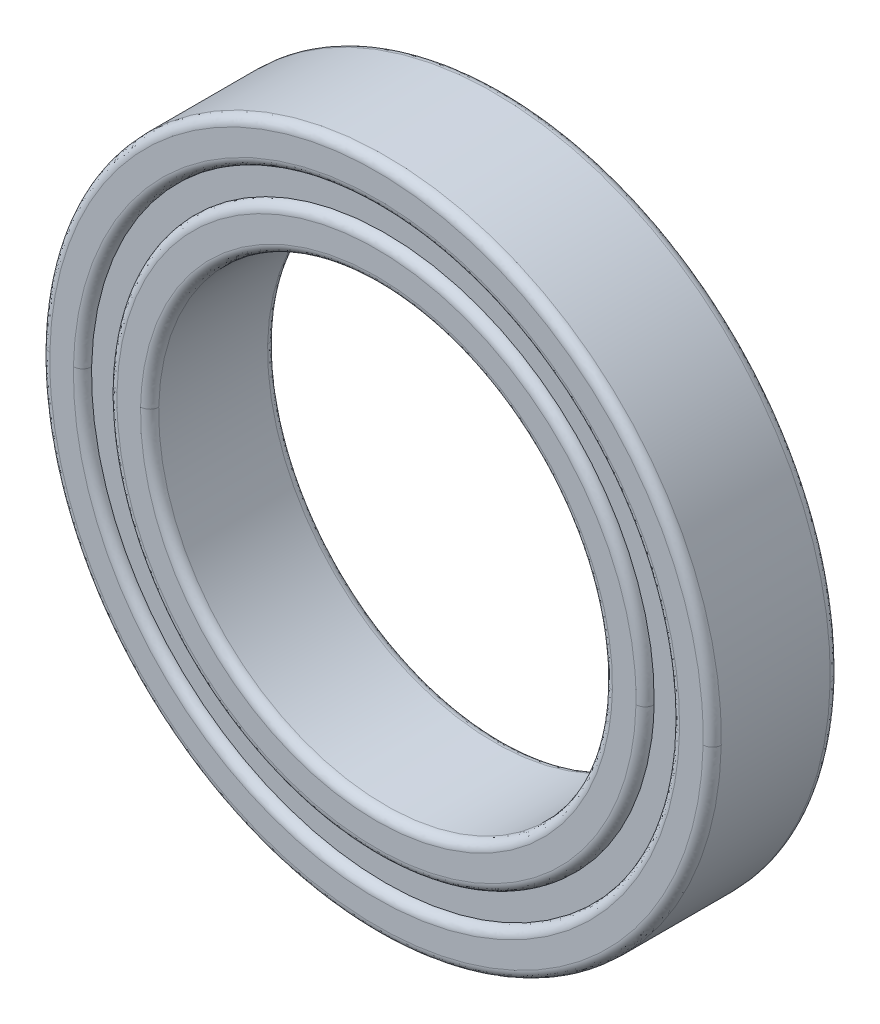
ISO-10303-21;
HEADER;
FILE_DESCRIPTION(('STEP AP214'),'2;1');
FILE_NAME('part.step','',(''),(''),'','','');
FILE_SCHEMA(('AUTOMOTIVE_DESIGN { 1 0 10303 214 1 1 1 1 }'));
ENDSEC;
DATA;
#1=APPLICATION_CONTEXT('core data for automotive mechanical design processes');
#2=APPLICATION_PROTOCOL_DEFINITION('international standard','automotive_design',2000,#1);
#3=PRODUCT_CONTEXT('',#1,'mechanical');
#4=PRODUCT('Part','Part','',(#3));
#5=PRODUCT_RELATED_PRODUCT_CATEGORY('part','',(#4));
#6=PRODUCT_DEFINITION_FORMATION('','',#4);
#7=PRODUCT_DEFINITION_CONTEXT('part definition',#1,'design');
#8=PRODUCT_DEFINITION('design','',#6,#7);
#9=PRODUCT_DEFINITION_SHAPE('','',#8);
#10=(LENGTH_UNIT() NAMED_UNIT(*) SI_UNIT(.MILLI.,.METRE.));
#11=(NAMED_UNIT(*) PLANE_ANGLE_UNIT() SI_UNIT($,.RADIAN.));
#12=(NAMED_UNIT(*) SI_UNIT($,.STERADIAN.) SOLID_ANGLE_UNIT());
#13=UNCERTAINTY_MEASURE_WITH_UNIT(LENGTH_MEASURE(1.E-05),#10,'distance_accuracy_value','');
#14=(GEOMETRIC_REPRESENTATION_CONTEXT(3) GLOBAL_UNCERTAINTY_ASSIGNED_CONTEXT((#13)) GLOBAL_UNIT_ASSIGNED_CONTEXT((#10,
#11,#12)) REPRESENTATION_CONTEXT('',''));
#15=CARTESIAN_POINT('',(0.,0.,0.));
#16=DIRECTION('',(0.,0.,1.));
#17=DIRECTION('',(1.,0.,0.));
#18=AXIS2_PLACEMENT_3D('',#15,#16,#17);
#19=CARTESIAN_POINT('',(-12.497421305,0.25389115,33.5));
#20=CARTESIAN_POINT('',(-13.005203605,-24.740951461,33.5));
#21=CARTESIAN_POINT('',(11.989639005,-25.248733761,33.5));
#22=CARTESIAN_POINT('',(12.497421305,-0.25389115,33.5));
#23=CARTESIAN_POINT('',(-12.497421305,0.253891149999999,33.792893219));
#24=CARTESIAN_POINT('',(-13.005203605,-24.740951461,33.792893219));
#25=CARTESIAN_POINT('',(11.989639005,-25.2487337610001,33.792893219));
#26=CARTESIAN_POINT('',(12.497421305,-0.25389115,33.792893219));
#27=CARTESIAN_POINT('',(-12.704485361,0.258097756,34.));
#28=CARTESIAN_POINT('',(-13.220680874,-25.1508729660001,34.));
#29=CARTESIAN_POINT('',(12.188289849,-25.667068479,34.));
#30=CARTESIAN_POINT('',(12.704485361,-0.258097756,34.));
#31=CARTESIAN_POINT('',(-12.997318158,0.264046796,34.));
#32=CARTESIAN_POINT('',(-13.52541175,-25.7305895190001,34.));
#33=CARTESIAN_POINT('',(12.469224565,-26.258683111,34.));
#34=CARTESIAN_POINT('',(12.997318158,-0.264046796,34.));
#35=(BOUNDED_SURFACE() B_SPLINE_SURFACE(3,3,((#19,#20,#21,#22),(#23,#24,#25,#26),(#27,#28,#29,
#30),(#31,#32,#33,#34)),.UNSPECIFIED.,.F.,.F.,.F.) B_SPLINE_SURFACE_WITH_KNOTS((4,4),(4,4),(0.,
1.),(0.,1.),.UNSPECIFIED.) GEOMETRIC_REPRESENTATION_ITEM() RATIONAL_B_SPLINE_SURFACE(((1.,
0.333333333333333,0.333333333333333,1.),(0.804737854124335,0.268245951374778,0.268245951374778,
0.804737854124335),(0.804737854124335,0.268245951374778,0.268245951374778,0.804737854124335),
(1.,0.333333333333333,0.333333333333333,1.))) REPRESENTATION_ITEM('') SURFACE());
#36=CARTESIAN_POINT('',(12.9973181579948,-0.264046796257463,33.5));
#37=DIRECTION('',(0.0203112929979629,0.99979370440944,0.));
#38=DIRECTION('',(-0.99979370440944,0.0203112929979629,0.));
#39=AXIS2_PLACEMENT_3D('',#36,#37,#38);
#40=CIRCLE('',#39,0.500000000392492);
#41=CARTESIAN_POINT('',(12.4974213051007,-0.253891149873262,33.5));
#42=VERTEX_POINT('',#41);
#43=CARTESIAN_POINT('',(12.997318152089,-0.264046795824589,34.0000000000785));
#44=VERTEX_POINT('',#43);
#45=EDGE_CURVE('E571',#42,#44,#40,.T.);
#46=CARTESIAN_POINT('',(0.,0.,33.5));
#47=DIRECTION('',(0.,0.,1.));
#48=DIRECTION('',(0.999793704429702,-0.0203112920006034,0.));
#49=AXIS2_PLACEMENT_3D('',#46,#47,#48);
#50=CIRCLE('',#49,12.4999999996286);
#51=CARTESIAN_POINT('',(-12.4974213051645,0.253891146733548,33.5));
#52=VERTEX_POINT('',#51);
#53=EDGE_CURVE('E578',#52,#42,#50,.T.);
#54=CARTESIAN_POINT('',(-12.9973181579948,0.264046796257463,33.5));
#55=DIRECTION('',(0.0203112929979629,0.99979370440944,0.));
#56=DIRECTION('',(-0.99979370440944,0.0203112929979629,0.));
#57=AXIS2_PLACEMENT_3D('',#54,#55,#56);
#58=CIRCLE('',#57,0.500000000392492);
#59=CARTESIAN_POINT('',(-12.997318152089,0.26404679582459,34.0000000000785));
#60=VERTEX_POINT('',#59);
#61=EDGE_CURVE('E569',#60,#52,#58,.T.);
#62=CARTESIAN_POINT('',(-12.997318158,0.264046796,34.));
#63=CARTESIAN_POINT('',(-13.52541175,-25.7305895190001,34.));
#64=CARTESIAN_POINT('',(12.469224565,-26.258683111,34.));
#65=CARTESIAN_POINT('',(12.997318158,-0.264046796,34.));
#66=(BOUNDED_CURVE() B_SPLINE_CURVE(3,(#62,#63,#64,#65),.UNSPECIFIED.,.F.,
.F.) B_SPLINE_CURVE_WITH_KNOTS((4,4),(0.,1.),
.UNSPECIFIED.) CURVE() GEOMETRIC_REPRESENTATION_ITEM() RATIONAL_B_SPLINE_CURVE((1.,
0.333333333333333,0.333333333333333,1.)) REPRESENTATION_ITEM(''));
#67=EDGE_CURVE('E588',#60,#44,#66,.T.);
#68=ORIENTED_EDGE('',*,*,#45,.F.);
#69=ORIENTED_EDGE('',*,*,#53,.F.);
#70=ORIENTED_EDGE('',*,*,#61,.F.);
#71=ORIENTED_EDGE('',*,*,#67,.T.);
#72=EDGE_LOOP('',(#68,#69,#70,#71));
#73=FACE_BOUND('',#72,.T.);
#74=ADVANCED_FACE('F17',(#73),#35,.T.);
#75=CARTESIAN_POINT('',(12.497421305,-0.25389115,33.5));
#76=CARTESIAN_POINT('',(13.005203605,24.740951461,33.5));
#77=CARTESIAN_POINT('',(-11.989639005,25.248733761,33.5));
#78=CARTESIAN_POINT('',(-12.497421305,0.25389115,33.5));
#79=CARTESIAN_POINT('',(12.497421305,-0.25389115,33.792893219));
#80=CARTESIAN_POINT('',(13.005203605,24.740951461,33.792893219));
#81=CARTESIAN_POINT('',(-11.989639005,25.248733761,33.792893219));
#82=CARTESIAN_POINT('',(-12.497421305,0.253891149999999,33.792893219));
#83=CARTESIAN_POINT('',(12.704485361,-0.258097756,34.));
#84=CARTESIAN_POINT('',(13.220680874,25.1508729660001,34.));
#85=CARTESIAN_POINT('',(-12.188289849,25.667068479,34.));
#86=CARTESIAN_POINT('',(-12.704485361,0.258097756,34.));
#87=CARTESIAN_POINT('',(12.997318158,-0.264046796,34.));
#88=CARTESIAN_POINT('',(13.52541175,25.7305895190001,34.));
#89=CARTESIAN_POINT('',(-12.469224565,26.258683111,34.));
#90=CARTESIAN_POINT('',(-12.997318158,0.264046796,34.));
#91=(BOUNDED_SURFACE() B_SPLINE_SURFACE(3,3,((#75,#76,#77,#78),(#79,#80,#81,#82),(#83,#84,#85,
#86),(#87,#88,#89,#90)),.UNSPECIFIED.,.F.,.F.,.F.) B_SPLINE_SURFACE_WITH_KNOTS((4,4),(4,4),(0.,
1.),(0.,1.),.UNSPECIFIED.) GEOMETRIC_REPRESENTATION_ITEM() RATIONAL_B_SPLINE_SURFACE(((1.,
0.333333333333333,0.333333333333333,1.),(0.804737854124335,0.268245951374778,0.268245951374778,
0.804737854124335),(0.804737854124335,0.268245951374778,0.268245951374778,0.804737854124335),
(1.,0.333333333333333,0.333333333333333,1.))) REPRESENTATION_ITEM('') SURFACE());
#92=CARTESIAN_POINT('',(0.,0.,33.5));
#93=DIRECTION('',(0.,0.,1.));
#94=DIRECTION('',(0.999793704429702,-0.0203112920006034,0.));
#95=AXIS2_PLACEMENT_3D('',#92,#93,#94);
#96=CIRCLE('',#95,12.4999999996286);
#97=EDGE_CURVE('E763',#42,#52,#96,.T.);
#98=CARTESIAN_POINT('',(12.997318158,-0.264046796,34.));
#99=CARTESIAN_POINT('',(13.52541175,25.7305895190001,34.));
#100=CARTESIAN_POINT('',(-12.469224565,26.258683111,34.));
#101=CARTESIAN_POINT('',(-12.997318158,0.264046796,34.));
#102=(BOUNDED_CURVE() B_SPLINE_CURVE(3,(#98,#99,#100,#101),.UNSPECIFIED.,.F.,
.F.) B_SPLINE_CURVE_WITH_KNOTS((4,4),(0.,1.),
.UNSPECIFIED.) CURVE() GEOMETRIC_REPRESENTATION_ITEM() RATIONAL_B_SPLINE_CURVE((1.,
0.333333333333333,0.333333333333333,1.)) REPRESENTATION_ITEM(''));
#103=EDGE_CURVE('E633',#44,#60,#102,.T.);
#104=ORIENTED_EDGE('',*,*,#97,.F.);
#105=ORIENTED_EDGE('',*,*,#45,.T.);
#106=ORIENTED_EDGE('',*,*,#103,.T.);
#107=ORIENTED_EDGE('',*,*,#61,.T.);
#108=EDGE_LOOP('',(#104,#105,#106,#107));
#109=FACE_BOUND('',#108,.T.);
#110=ADVANCED_FACE('F604',(#109),#91,.T.);
#111=CARTESIAN_POINT('',(0.,0.,27.5));
#112=DIRECTION('',(0.,0.,1.));
#113=DIRECTION('',(1.,0.,0.));
#114=AXIS2_PLACEMENT_3D('',#111,#112,#113);
#115=CYLINDRICAL_SURFACE('',#114,12.4999999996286);
#116=CARTESIAN_POINT('',(0.,0.,27.5));
#117=DIRECTION('',(0.,0.,1.));
#118=DIRECTION('',(1.,0.,0.));
#119=AXIS2_PLACEMENT_3D('',#116,#117,#118);
#120=CIRCLE('',#119,12.4999999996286);
#121=CARTESIAN_POINT('',(-12.4974213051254,0.253891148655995,27.5));
#122=VERTEX_POINT('',#121);
#123=CARTESIAN_POINT('',(12.497421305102,-0.253891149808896,27.5));
#124=VERTEX_POINT('',#123);
#125=EDGE_CURVE('E641',#122,#124,#120,.T.);
#126=ORIENTED_EDGE('',*,*,#125,.F.);
#127=CARTESIAN_POINT('',(0.,0.,27.5));
#128=DIRECTION('',(0.,0.,1.));
#129=DIRECTION('',(1.,0.,0.));
#130=AXIS2_PLACEMENT_3D('',#127,#128,#129);
#131=CIRCLE('',#130,12.4999999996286);
#132=EDGE_CURVE('E636',#124,#122,#131,.T.);
#133=ORIENTED_EDGE('',*,*,#132,.F.);
#134=EDGE_LOOP('',(#126,#133));
#135=FACE_BOUND('',#134,.T.);
#136=ORIENTED_EDGE('',*,*,#97,.T.);
#137=ORIENTED_EDGE('',*,*,#53,.T.);
#138=EDGE_LOOP('',(#136,#137));
#139=FACE_BOUND('',#138,.T.);
#140=ADVANCED_FACE('F615',(#135,#139),#115,.F.);
#141=CARTESIAN_POINT('',(14.17467768,-14.762551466,34.));
#142=DIRECTION('',(0.,0.,-1.));
#143=DIRECTION('',(-0.999793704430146,0.020311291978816,0.));
#144=AXIS2_PLACEMENT_3D('',#141,#142,#143);
#145=PLANE('',#144);
#146=ORIENTED_EDGE('',*,*,#67,.F.);
#147=ORIENTED_EDGE('',*,*,#103,.F.);
#148=EDGE_LOOP('',(#146,#147));
#149=FACE_BOUND('',#148,.T.);
#150=CARTESIAN_POINT('',(14.297049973,-0.290451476,34.));
#151=CARTESIAN_POINT('',(13.716147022,-28.884551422,34.));
#152=CARTESIAN_POINT('',(-14.877952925,-28.303648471,34.));
#153=CARTESIAN_POINT('',(-14.297049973,0.290451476,34.));
#154=(BOUNDED_CURVE() B_SPLINE_CURVE(3,(#150,#151,#152,#153),.UNSPECIFIED.,.F.,
.F.) B_SPLINE_CURVE_WITH_KNOTS((4,4),(0.,1.),
.UNSPECIFIED.) CURVE() GEOMETRIC_REPRESENTATION_ITEM() RATIONAL_B_SPLINE_CURVE((1.,
0.333333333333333,0.333333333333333,1.)) REPRESENTATION_ITEM(''));
#155=CARTESIAN_POINT('',(14.2970499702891,-0.290451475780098,34.0000000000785));
#156=VERTEX_POINT('',#155);
#157=CARTESIAN_POINT('',(-14.2970499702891,0.290451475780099,34.0000000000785));
#158=VERTEX_POINT('',#157);
#159=EDGE_CURVE('E701',#156,#158,#154,.T.);
#160=ORIENTED_EDGE('',*,*,#159,.F.);
#161=CARTESIAN_POINT('',(-14.297049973,0.290451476,34.));
#162=CARTESIAN_POINT('',(-13.716147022,28.884551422,34.));
#163=CARTESIAN_POINT('',(14.877952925,28.303648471,34.));
#164=CARTESIAN_POINT('',(14.297049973,-0.290451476,34.));
#165=(BOUNDED_CURVE() B_SPLINE_CURVE(3,(#161,#162,#163,#164),.UNSPECIFIED.,.F.,
.F.) B_SPLINE_CURVE_WITH_KNOTS((4,4),(0.,1.),
.UNSPECIFIED.) CURVE() GEOMETRIC_REPRESENTATION_ITEM() RATIONAL_B_SPLINE_CURVE((1.,
0.333333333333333,0.333333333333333,1.)) REPRESENTATION_ITEM(''));
#166=EDGE_CURVE('E144',#158,#156,#165,.T.);
#167=ORIENTED_EDGE('',*,*,#166,.F.);
#168=EDGE_LOOP('',(#160,#167));
#169=FACE_BOUND('',#168,.T.);
#170=ADVANCED_FACE('F411',(#149,#169),#145,.F.);
#171=CARTESIAN_POINT('',(-12.997318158,0.264046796,27.));
#172=CARTESIAN_POINT('',(-13.52541175,-25.7305895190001,27.));
#173=CARTESIAN_POINT('',(12.469224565,-26.258683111,27.));
#174=CARTESIAN_POINT('',(12.997318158,-0.264046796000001,27.));
#175=CARTESIAN_POINT('',(-12.704485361,0.258097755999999,27.));
#176=CARTESIAN_POINT('',(-13.220680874,-25.1508729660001,27.));
#177=CARTESIAN_POINT('',(12.188289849,-25.667068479,27.));
#178=CARTESIAN_POINT('',(12.704485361,-0.258097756,27.));
#179=CARTESIAN_POINT('',(-12.497421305,0.25389115,27.207106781));
#180=CARTESIAN_POINT('',(-13.005203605,-24.740951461,27.207106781));
#181=CARTESIAN_POINT('',(11.989639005,-25.2487337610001,27.207106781));
#182=CARTESIAN_POINT('',(12.497421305,-0.25389115,27.207106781));
#183=CARTESIAN_POINT('',(-12.497421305,0.25389115,27.5));
#184=CARTESIAN_POINT('',(-13.005203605,-24.740951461,27.5));
#185=CARTESIAN_POINT('',(11.989639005,-25.248733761,27.5));
#186=CARTESIAN_POINT('',(12.497421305,-0.25389115,27.5));
#187=(BOUNDED_SURFACE() B_SPLINE_SURFACE(3,3,((#171,#172,#173,#174),(#175,#176,#177,#178),(#179,
#180,#181,#182),(#183,#184,#185,#186)),.UNSPECIFIED.,.F.,.F.,
.F.) B_SPLINE_SURFACE_WITH_KNOTS((4,4),(4,4),(0.,1.),(0.,1.),
.UNSPECIFIED.) GEOMETRIC_REPRESENTATION_ITEM() RATIONAL_B_SPLINE_SURFACE(((1.,0.333333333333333,
0.333333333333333,1.),(0.804737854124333,0.268245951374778,0.268245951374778,0.804737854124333),
(0.804737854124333,0.268245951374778,0.268245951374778,0.804737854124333),(1.,0.333333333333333,
0.333333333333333,1.))) REPRESENTATION_ITEM('') SURFACE());
#188=CARTESIAN_POINT('',(12.9973181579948,-0.264046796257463,27.5));
#189=DIRECTION('',(0.0203112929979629,0.99979370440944,0.));
#190=DIRECTION('',(-0.99979370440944,0.0203112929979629,0.));
#191=AXIS2_PLACEMENT_3D('',#188,#189,#190);
#192=CIRCLE('',#191,0.500000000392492);
#193=CARTESIAN_POINT('',(12.997318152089,-0.26404679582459,26.9999999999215));
#194=VERTEX_POINT('',#193);
#195=EDGE_CURVE('E696',#194,#124,#192,.T.);
#196=CARTESIAN_POINT('',(12.997318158,-0.264046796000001,27.));
#197=CARTESIAN_POINT('',(12.469224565,-26.258683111,27.));
#198=CARTESIAN_POINT('',(-13.52541175,-25.7305895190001,27.));
#199=CARTESIAN_POINT('',(-12.997318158,0.264046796,27.));
#200=(BOUNDED_CURVE() B_SPLINE_CURVE(3,(#196,#197,#198,#199),.UNSPECIFIED.,.F.,
.F.) B_SPLINE_CURVE_WITH_KNOTS((4,4),(0.,1.),
.UNSPECIFIED.) CURVE() GEOMETRIC_REPRESENTATION_ITEM() RATIONAL_B_SPLINE_CURVE((1.,
0.333333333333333,0.333333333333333,1.)) REPRESENTATION_ITEM(''));
#201=CARTESIAN_POINT('',(-12.997318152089,0.264046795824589,26.9999999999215));
#202=VERTEX_POINT('',#201);
#203=EDGE_CURVE('E147',#194,#202,#200,.T.);
#204=CARTESIAN_POINT('',(-12.9973181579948,0.264046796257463,27.5));
#205=DIRECTION('',(0.0203112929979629,0.99979370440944,0.));
#206=DIRECTION('',(-0.99979370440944,0.0203112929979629,0.));
#207=AXIS2_PLACEMENT_3D('',#204,#205,#206);
#208=CIRCLE('',#207,0.500000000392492);
#209=EDGE_CURVE('E640',#122,#202,#208,.T.);
#210=ORIENTED_EDGE('',*,*,#195,.F.);
#211=ORIENTED_EDGE('',*,*,#203,.T.);
#212=ORIENTED_EDGE('',*,*,#209,.F.);
#213=ORIENTED_EDGE('',*,*,#125,.T.);
#214=EDGE_LOOP('',(#210,#211,#212,#213));
#215=FACE_BOUND('',#214,.T.);
#216=ADVANCED_FACE('F672',(#215),#187,.T.);
#217=CARTESIAN_POINT('',(12.997318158,-0.264046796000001,27.));
#218=CARTESIAN_POINT('',(13.52541175,25.7305895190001,27.));
#219=CARTESIAN_POINT('',(-12.469224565,26.258683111,27.));
#220=CARTESIAN_POINT('',(-12.997318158,0.264046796,27.));
#221=CARTESIAN_POINT('',(12.704485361,-0.258097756,27.));
#222=CARTESIAN_POINT('',(13.220680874,25.1508729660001,27.));
#223=CARTESIAN_POINT('',(-12.188289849,25.667068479,27.));
#224=CARTESIAN_POINT('',(-12.704485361,0.258097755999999,27.));
#225=CARTESIAN_POINT('',(12.497421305,-0.25389115,27.207106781));
#226=CARTESIAN_POINT('',(13.005203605,24.740951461,27.207106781));
#227=CARTESIAN_POINT('',(-11.989639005,25.248733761,27.207106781));
#228=CARTESIAN_POINT('',(-12.497421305,0.25389115,27.207106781));
#229=CARTESIAN_POINT('',(12.497421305,-0.25389115,27.5));
#230=CARTESIAN_POINT('',(13.005203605,24.740951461,27.5));
#231=CARTESIAN_POINT('',(-11.989639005,25.248733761,27.5));
#232=CARTESIAN_POINT('',(-12.497421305,0.25389115,27.5));
#233=(BOUNDED_SURFACE() B_SPLINE_SURFACE(3,3,((#217,#218,#219,#220),(#221,#222,#223,#224),(#225,
#226,#227,#228),(#229,#230,#231,#232)),.UNSPECIFIED.,.F.,.F.,
.F.) B_SPLINE_SURFACE_WITH_KNOTS((4,4),(4,4),(0.,1.),(0.,1.),
.UNSPECIFIED.) GEOMETRIC_REPRESENTATION_ITEM() RATIONAL_B_SPLINE_SURFACE(((1.,0.333333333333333,
0.333333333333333,1.),(0.804737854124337,0.268245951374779,0.268245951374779,0.804737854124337),
(0.804737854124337,0.268245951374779,0.268245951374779,0.804737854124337),(1.,0.333333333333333,
0.333333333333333,1.))) REPRESENTATION_ITEM('') SURFACE());
#234=CARTESIAN_POINT('',(-12.997318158,0.264046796,27.));
#235=CARTESIAN_POINT('',(-12.469224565,26.258683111,27.));
#236=CARTESIAN_POINT('',(13.52541175,25.7305895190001,27.));
#237=CARTESIAN_POINT('',(12.997318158,-0.264046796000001,27.));
#238=(BOUNDED_CURVE() B_SPLINE_CURVE(3,(#234,#235,#236,#237),.UNSPECIFIED.,.F.,
.F.) B_SPLINE_CURVE_WITH_KNOTS((4,4),(0.,1.),
.UNSPECIFIED.) CURVE() GEOMETRIC_REPRESENTATION_ITEM() RATIONAL_B_SPLINE_CURVE((1.,
0.333333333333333,0.333333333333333,1.)) REPRESENTATION_ITEM(''));
#239=EDGE_CURVE('E140',#202,#194,#238,.T.);
#240=ORIENTED_EDGE('',*,*,#239,.T.);
#241=ORIENTED_EDGE('',*,*,#195,.T.);
#242=ORIENTED_EDGE('',*,*,#132,.T.);
#243=ORIENTED_EDGE('',*,*,#209,.T.);
#244=EDGE_LOOP('',(#240,#241,#242,#243));
#245=FACE_BOUND('',#244,.T.);
#246=ADVANCED_FACE('F661',(#245),#233,.T.);
#247=CARTESIAN_POINT('',(-14.297049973,0.290451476,34.));
#248=CARTESIAN_POINT('',(-14.877952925,-28.303648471,34.));
#249=CARTESIAN_POINT('',(13.716147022,-28.884551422,34.));
#250=CARTESIAN_POINT('',(14.297049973,-0.290451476,34.));
#251=CARTESIAN_POINT('',(-14.58988277,0.296400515,34.));
#252=CARTESIAN_POINT('',(-15.1826838,-28.883365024,34.));
#253=CARTESIAN_POINT('',(13.997081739,-29.476166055,34.));
#254=CARTESIAN_POINT('',(14.58988277,-0.296400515,34.));
#255=CARTESIAN_POINT('',(-14.796946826,0.300607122,33.792893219));
#256=CARTESIAN_POINT('',(-15.398161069,-29.293286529,33.792893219));
#257=CARTESIAN_POINT('',(14.195732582,-29.8945007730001,33.792893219));
#258=CARTESIAN_POINT('',(14.796946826,-0.300607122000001,33.792893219));
#259=CARTESIAN_POINT('',(-14.796946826,0.300607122,33.5));
#260=CARTESIAN_POINT('',(-15.398161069,-29.2932865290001,33.5));
#261=CARTESIAN_POINT('',(14.195732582,-29.8945007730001,33.5));
#262=CARTESIAN_POINT('',(14.796946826,-0.300607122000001,33.5));
#263=(BOUNDED_SURFACE() B_SPLINE_SURFACE(3,3,((#247,#248,#249,#250),(#251,#252,#253,#254),(#255,
#256,#257,#258),(#259,#260,#261,#262)),.UNSPECIFIED.,.F.,.F.,
.F.) B_SPLINE_SURFACE_WITH_KNOTS((4,4),(4,4),(0.,1.),(0.,1.),
.UNSPECIFIED.) GEOMETRIC_REPRESENTATION_ITEM() RATIONAL_B_SPLINE_SURFACE(((1.,0.333333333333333,
0.333333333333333,1.),(0.804737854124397,0.268245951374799,0.268245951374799,0.804737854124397),
(0.804737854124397,0.268245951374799,0.268245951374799,0.804737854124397),(1.,0.333333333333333,
0.333333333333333,1.))) REPRESENTATION_ITEM('') SURFACE());
#264=CARTESIAN_POINT('',(14.2970499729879,-0.290451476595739,33.5));
#265=DIRECTION('',(0.0203112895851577,0.999793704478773,0.));
#266=DIRECTION('',(-0.999793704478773,0.0203112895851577,0.));
#267=AXIS2_PLACEMENT_3D('',#264,#265,#266);
#268=CIRCLE('',#267,0.50000000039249);
#269=CARTESIAN_POINT('',(14.7969468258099,-0.300607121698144,33.5));
#270=VERTEX_POINT('',#269);
#271=EDGE_CURVE('E134',#156,#270,#268,.T.);
#272=CARTESIAN_POINT('',(-14.2970499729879,0.290451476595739,33.5));
#273=DIRECTION('',(0.0203112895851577,0.999793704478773,0.));
#274=DIRECTION('',(-0.999793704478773,0.0203112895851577,0.));
#275=AXIS2_PLACEMENT_3D('',#272,#273,#274);
#276=CIRCLE('',#275,0.50000000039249);
#277=CARTESIAN_POINT('',(-14.7969468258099,0.300607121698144,33.5));
#278=VERTEX_POINT('',#277);
#279=EDGE_CURVE('E128',#278,#158,#276,.T.);
#280=CARTESIAN_POINT('',(-14.7969468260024,0.300607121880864,33.5));
#281=CARTESIAN_POINT('',(-14.800334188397,0.133864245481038,33.5));
#282=CARTESIAN_POINT('',(-14.8009027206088,-0.0329227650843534,33.5));
#283=CARTESIAN_POINT('',(-14.7964026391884,-0.366471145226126,33.5));
#284=CARTESIAN_POINT('',(-14.7913323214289,-0.533232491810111,33.5));
#285=CARTESIAN_POINT('',(-14.7676332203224,-1.03379208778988,33.5));
#286=CARTESIAN_POINT('',(-14.7405033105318,-1.36722765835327,33.5));
#287=CARTESIAN_POINT('',(-14.6637212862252,-2.03153328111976,33.5));
#288=CARTESIAN_POINT('',(-14.6140646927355,-2.36240280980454,33.5));
#289=CARTESIAN_POINT('',(-14.4924553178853,-3.02002163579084,33.5));
#290=CARTESIAN_POINT('',(-14.4205030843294,-3.34677103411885,33.5));
#291=CARTESIAN_POINT('',(-14.254651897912,-3.99458352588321,33.5));
#292=CARTESIAN_POINT('',(-14.1607562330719,-4.31564746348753,33.5));
#293=CARTESIAN_POINT('',(-13.9277698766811,-5.02246730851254,33.5));
#294=CARTESIAN_POINT('',(-13.7832611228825,-5.4064507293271,33.5));
#295=CARTESIAN_POINT('',(-13.4627075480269,-6.16148735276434,33.5));
#296=CARTESIAN_POINT('',(-13.2866287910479,-6.53252612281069,33.5));
#297=CARTESIAN_POINT('',(-12.9016233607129,-7.26368642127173,33.5));
#298=CARTESIAN_POINT('',(-12.6922788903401,-7.62358811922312,33.5));
#299=CARTESIAN_POINT('',(-12.2439195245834,-8.32464089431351,33.5));
#300=CARTESIAN_POINT('',(-12.004890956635,-8.6657832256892,33.5));
#301=CARTESIAN_POINT('',(-11.4989321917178,-9.32672347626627,33.5));
#302=CARTESIAN_POINT('',(-11.2320012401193,-9.64652081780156,33.5));
#303=CARTESIAN_POINT('',(-10.6722690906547,-10.2623450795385,33.5));
#304=CARTESIAN_POINT('',(-10.3794798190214,-10.5583828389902,33.5));
#305=CARTESIAN_POINT('',(-9.77412792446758,-11.1209189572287,33.5));
#306=CARTESIAN_POINT('',(-9.46188573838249,-11.3877622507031,33.5));
#307=CARTESIAN_POINT('',(-8.81670241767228,-11.8942740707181,33.5));
#308=CARTESIAN_POINT('',(-8.48378698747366,-12.1339753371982,33.5));
#309=CARTESIAN_POINT('',(-7.79921735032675,-12.5849196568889,33.5));
#310=CARTESIAN_POINT('',(-7.44756342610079,-12.7961631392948,33.5));
#311=CARTESIAN_POINT('',(-6.72748897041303,-13.1889843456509,33.5));
#312=CARTESIAN_POINT('',(-6.3590480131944,-13.3705246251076,33.5));
#313=CARTESIAN_POINT('',(-5.60316644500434,-13.7046569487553,33.5));
#314=CARTESIAN_POINT('',(-5.21553369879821,-13.8568145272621,33.5));
#315=CARTESIAN_POINT('',(-4.4286509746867,-14.1279974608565,33.5));
#316=CARTESIAN_POINT('',(-4.02939579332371,-14.2470077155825,33.5));
#317=CARTESIAN_POINT('',(-3.22239796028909,-14.4509275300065,33.5));
#318=CARTESIAN_POINT('',(-2.81465790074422,-14.5358473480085,33.5));
#319=CARTESIAN_POINT('',(-1.99365395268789,-14.6710035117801,33.5));
#320=CARTESIAN_POINT('',(-1.58039259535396,-14.7212552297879,33.5));
#321=CARTESIAN_POINT('',(-0.756897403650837,-14.7863219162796,33.5));
#322=CARTESIAN_POINT('',(-0.346701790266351,-14.8016215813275,33.5));
#323=CARTESIAN_POINT('',(0.473543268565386,-14.7981066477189,33.5));
#324=CARTESIAN_POINT('',(0.883592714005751,-14.7792920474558,33.5));
#325=CARTESIAN_POINT('',(1.70650013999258,-14.7071701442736,33.5));
#326=CARTESIAN_POINT('',(2.11931574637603,-14.653378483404,33.5));
#327=CARTESIAN_POINT('',(2.9391314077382,-14.5111909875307,33.5));
#328=CARTESIAN_POINT('',(3.34612879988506,-14.4227798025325,33.5));
#329=CARTESIAN_POINT('',(4.15134933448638,-14.2119512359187,33.5));
#330=CARTESIAN_POINT('',(4.54956980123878,-14.0895236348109,33.5));
#331=CARTESIAN_POINT('',(5.33409931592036,-13.8116068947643,33.5));
#332=CARTESIAN_POINT('',(5.72041369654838,-13.6561328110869,33.5));
#333=CARTESIAN_POINT('',(6.47340336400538,-13.315534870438,33.5));
#334=CARTESIAN_POINT('',(6.84027451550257,-13.1308438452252,33.5));
#335=CARTESIAN_POINT('',(7.55695597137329,-12.7318658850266,33.5));
#336=CARTESIAN_POINT('',(7.90678698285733,-12.517616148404,33.5));
#337=CARTESIAN_POINT('',(8.58746878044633,-12.0608200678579,33.5));
#338=CARTESIAN_POINT('',(8.91831921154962,-11.8182731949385,33.5));
#339=CARTESIAN_POINT('',(9.55913768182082,-11.3062503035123,33.5));
#340=CARTESIAN_POINT('',(9.8690799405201,-11.0367420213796,33.5));
#341=CARTESIAN_POINT('',(10.4695782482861,-10.4690482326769,33.5));
#342=CARTESIAN_POINT('',(10.7598115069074,-10.1705211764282,33.5));
#343=CARTESIAN_POINT('',(11.3142310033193,-9.54994147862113,33.5));
#344=CARTESIAN_POINT('',(11.5784051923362,-9.22787807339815,33.5));
#345=CARTESIAN_POINT('',(12.078684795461,-8.56262763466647,33.5));
#346=CARTESIAN_POINT('',(12.3147893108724,-8.21943992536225,33.5));
#347=CARTESIAN_POINT('',(12.7571385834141,-7.51454977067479,33.5));
#348=CARTESIAN_POINT('',(12.9633972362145,-7.15285604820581,33.5));
#349=CARTESIAN_POINT('',(13.3421451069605,-6.4183809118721,33.5));
#350=CARTESIAN_POINT('',(13.5150517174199,-6.04581443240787,33.5));
#351=CARTESIAN_POINT('',(13.8291216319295,-5.28803682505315,33.5));
#352=CARTESIAN_POINT('',(13.9703254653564,-4.90284257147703,33.5));
#353=CARTESIAN_POINT('',(14.1575897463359,-4.31792268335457,33.5));
#354=CARTESIAN_POINT('',(14.2158597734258,-4.1220260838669,33.5));
#355=CARTESIAN_POINT('',(14.3242467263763,-3.7279625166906,33.5));
#356=CARTESIAN_POINT('',(14.3743629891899,-3.52979536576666,33.5));
#357=CARTESIAN_POINT('',(14.477661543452,-3.08255731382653,33.5));
#358=CARTESIAN_POINT('',(14.5285647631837,-2.83295740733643,33.5));
#359=CARTESIAN_POINT('',(14.6174338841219,-2.33141698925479,33.5));
#360=CARTESIAN_POINT('',(14.6553971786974,-2.07947601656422,33.5));
#361=CARTESIAN_POINT('',(14.7183258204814,-1.57352239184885,33.5));
#362=CARTESIAN_POINT('',(14.7432680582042,-1.31950686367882,33.5));
#363=CARTESIAN_POINT('',(14.7799897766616,-0.810574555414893,33.5));
#364=CARTESIAN_POINT('',(14.7917717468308,-0.555657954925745,33.5));
#365=CARTESIAN_POINT('',(14.796946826,-0.300607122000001,33.5));
#366=B_SPLINE_CURVE_WITH_KNOTS('',3,(#280,#281,#282,#283,#284,#285,#286,#287,#288,#289,#290,
#291,#292,#293,#294,#295,#296,#297,#298,#299,#300,#301,#302,#303,#304,#305,#306,#307,#308,#309,
#310,#311,#312,#313,#314,#315,#316,#317,#318,#319,#320,#321,#322,#323,#324,#325,#326,#327,#328,
#329,#330,#331,#332,#333,#334,#335,#336,#337,#338,#339,#340,#341,#342,#343,#344,#345,#346,#347,
#348,#349,#350,#351,#352,#353,#354,#355,#356,#357,#358,#359,#360,#361,#362,#363,#364,#365),
.UNSPECIFIED.,.F.,.F.,(4,2,2,2,2,2,2,2,2,2,2,2,2,2,2,2,2,2,2,2,2,2,2,2,2,2,2,2,2,2,2,2,2,2,2,2,
2,2,2,2,2,2,4),(0.,0.500281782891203,1.00071479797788,2.00349196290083,3.00646859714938,
4.0094205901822,5.01222239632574,6.24158520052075,7.4722775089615,8.71986670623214,
9.96803269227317,11.2162324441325,12.4638594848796,13.694637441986,14.9239145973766,
16.1531732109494,17.3839697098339,18.6317659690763,19.8801297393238,21.128117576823,
22.3755516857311,23.6055792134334,24.8356067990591,26.0830412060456,27.331029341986,
28.5793928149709,29.8271887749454,31.0579838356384,32.2872438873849,33.5165269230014,
34.747298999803,35.9948896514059,37.2430544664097,38.4912592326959,39.7388809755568,
40.9696998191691,42.1989360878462,42.8119287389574,43.4249712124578,44.1888357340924,
44.9528540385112,45.7182237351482,46.483448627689),.UNSPECIFIED.);
#367=EDGE_CURVE('E22',#278,#270,#366,.T.);
#368=ORIENTED_EDGE('',*,*,#271,.F.);
#369=ORIENTED_EDGE('',*,*,#159,.T.);
#370=ORIENTED_EDGE('',*,*,#279,.F.);
#371=ORIENTED_EDGE('',*,*,#367,.T.);
#372=EDGE_LOOP('',(#368,#369,#370,#371));
#373=FACE_BOUND('',#372,.T.);
#374=ADVANCED_FACE('F133',(#373),#263,.T.);
#375=CARTESIAN_POINT('',(14.297049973,-0.290451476,34.));
#376=CARTESIAN_POINT('',(14.877952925,28.303648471,34.));
#377=CARTESIAN_POINT('',(-13.716147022,28.884551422,34.));
#378=CARTESIAN_POINT('',(-14.297049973,0.290451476,34.));
#379=CARTESIAN_POINT('',(14.58988277,-0.296400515,34.));
#380=CARTESIAN_POINT('',(15.1826838,28.883365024,34.));
#381=CARTESIAN_POINT('',(-13.997081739,29.476166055,34.0000000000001));
#382=CARTESIAN_POINT('',(-14.58988277,0.296400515,34.));
#383=CARTESIAN_POINT('',(14.796946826,-0.300607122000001,33.792893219));
#384=CARTESIAN_POINT('',(15.398161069,29.2932865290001,33.792893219));
#385=CARTESIAN_POINT('',(-14.195732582,29.8945007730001,33.792893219));
#386=CARTESIAN_POINT('',(-14.796946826,0.300607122,33.792893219));
#387=CARTESIAN_POINT('',(14.796946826,-0.300607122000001,33.5));
#388=CARTESIAN_POINT('',(15.398161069,29.2932865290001,33.5));
#389=CARTESIAN_POINT('',(-14.195732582,29.8945007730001,33.5));
#390=CARTESIAN_POINT('',(-14.796946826,0.300607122,33.5));
#391=(BOUNDED_SURFACE() B_SPLINE_SURFACE(3,3,((#375,#376,#377,#378),(#379,#380,#381,#382),(#383,
#384,#385,#386),(#387,#388,#389,#390)),.UNSPECIFIED.,.F.,.F.,
.F.) B_SPLINE_SURFACE_WITH_KNOTS((4,4),(4,4),(0.,1.),(0.,1.),
.UNSPECIFIED.) GEOMETRIC_REPRESENTATION_ITEM() RATIONAL_B_SPLINE_SURFACE(((1.,0.333333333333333,
0.333333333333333,1.),(0.804737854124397,0.268245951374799,0.268245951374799,0.804737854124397),
(0.804737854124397,0.268245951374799,0.268245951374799,0.804737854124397),(1.,0.333333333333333,
0.333333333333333,1.))) REPRESENTATION_ITEM('') SURFACE());
#392=CARTESIAN_POINT('',(14.7969468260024,-0.300607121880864,33.5));
#393=CARTESIAN_POINT('',(14.800334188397,-0.133864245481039,33.5));
#394=CARTESIAN_POINT('',(14.8009027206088,0.0329227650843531,33.5));
#395=CARTESIAN_POINT('',(14.7964026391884,0.366471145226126,33.5));
#396=CARTESIAN_POINT('',(14.7913323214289,0.533232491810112,33.5));
#397=CARTESIAN_POINT('',(14.7676332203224,1.03379208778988,33.5));
#398=CARTESIAN_POINT('',(14.7405033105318,1.36722765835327,33.5));
#399=CARTESIAN_POINT('',(14.6637212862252,2.03153328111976,33.5));
#400=CARTESIAN_POINT('',(14.6140646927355,2.36240280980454,33.5));
#401=CARTESIAN_POINT('',(14.4924553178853,3.02002163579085,33.5));
#402=CARTESIAN_POINT('',(14.4205030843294,3.34677103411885,33.5));
#403=CARTESIAN_POINT('',(14.254651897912,3.99458352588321,33.5));
#404=CARTESIAN_POINT('',(14.1607562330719,4.31564746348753,33.5));
#405=CARTESIAN_POINT('',(13.9277698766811,5.02246730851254,33.5));
#406=CARTESIAN_POINT('',(13.7832611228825,5.4064507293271,33.5));
#407=CARTESIAN_POINT('',(13.4627075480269,6.16148735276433,33.5));
#408=CARTESIAN_POINT('',(13.2866287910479,6.53252612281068,33.5));
#409=CARTESIAN_POINT('',(12.9016233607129,7.26368642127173,33.5));
#410=CARTESIAN_POINT('',(12.6922788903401,7.62358811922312,33.5));
#411=CARTESIAN_POINT('',(12.2439195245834,8.32464089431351,33.5));
#412=CARTESIAN_POINT('',(12.004890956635,8.6657832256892,33.5));
#413=CARTESIAN_POINT('',(11.4989321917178,9.32672347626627,33.5));
#414=CARTESIAN_POINT('',(11.2320012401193,9.64652081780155,33.5));
#415=CARTESIAN_POINT('',(10.6722690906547,10.2623450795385,33.5));
#416=CARTESIAN_POINT('',(10.3794798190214,10.5583828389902,33.5));
#417=CARTESIAN_POINT('',(9.77412792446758,11.1209189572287,33.5));
#418=CARTESIAN_POINT('',(9.46188573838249,11.3877622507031,33.5));
#419=CARTESIAN_POINT('',(8.81670241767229,11.8942740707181,33.5));
#420=CARTESIAN_POINT('',(8.48378698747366,12.1339753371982,33.5));
#421=CARTESIAN_POINT('',(7.79921735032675,12.5849196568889,33.5));
#422=CARTESIAN_POINT('',(7.44756342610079,12.7961631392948,33.5));
#423=CARTESIAN_POINT('',(6.72748897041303,13.188984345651,33.5));
#424=CARTESIAN_POINT('',(6.3590480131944,13.3705246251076,33.5));
#425=CARTESIAN_POINT('',(5.60316644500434,13.7046569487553,33.5));
#426=CARTESIAN_POINT('',(5.21553369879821,13.8568145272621,33.5));
#427=CARTESIAN_POINT('',(4.4286509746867,14.1279974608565,33.5));
#428=CARTESIAN_POINT('',(4.02939579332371,14.2470077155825,33.5));
#429=CARTESIAN_POINT('',(3.22239796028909,14.4509275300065,33.5));
#430=CARTESIAN_POINT('',(2.81465790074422,14.5358473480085,33.5));
#431=CARTESIAN_POINT('',(1.99365395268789,14.6710035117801,33.5));
#432=CARTESIAN_POINT('',(1.58039259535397,14.7212552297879,33.5));
#433=CARTESIAN_POINT('',(0.756897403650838,14.7863219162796,33.5));
#434=CARTESIAN_POINT('',(0.346701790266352,14.8016215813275,33.5));
#435=CARTESIAN_POINT('',(-0.473543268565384,14.7981066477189,33.5));
#436=CARTESIAN_POINT('',(-0.88359271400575,14.7792920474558,33.5));
#437=CARTESIAN_POINT('',(-1.70650013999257,14.7071701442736,33.5));
#438=CARTESIAN_POINT('',(-2.11931574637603,14.653378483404,33.5));
#439=CARTESIAN_POINT('',(-2.93913140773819,14.5111909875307,33.5));
#440=CARTESIAN_POINT('',(-3.34612879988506,14.4227798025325,33.5));
#441=CARTESIAN_POINT('',(-4.15134933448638,14.2119512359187,33.5));
#442=CARTESIAN_POINT('',(-4.54956980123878,14.0895236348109,33.5));
#443=CARTESIAN_POINT('',(-5.33409931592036,13.8116068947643,33.5));
#444=CARTESIAN_POINT('',(-5.72041369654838,13.6561328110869,33.5));
#445=CARTESIAN_POINT('',(-6.47340336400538,13.315534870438,33.5));
#446=CARTESIAN_POINT('',(-6.84027451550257,13.1308438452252,33.5));
#447=CARTESIAN_POINT('',(-7.55695597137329,12.7318658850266,33.5));
#448=CARTESIAN_POINT('',(-7.90678698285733,12.517616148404,33.5));
#449=CARTESIAN_POINT('',(-8.58746878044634,12.0608200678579,33.5));
#450=CARTESIAN_POINT('',(-8.91831921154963,11.8182731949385,33.5));
#451=CARTESIAN_POINT('',(-9.55913768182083,11.3062503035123,33.5));
#452=CARTESIAN_POINT('',(-9.86907994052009,11.0367420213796,33.5));
#453=CARTESIAN_POINT('',(-10.4695782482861,10.4690482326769,33.5));
#454=CARTESIAN_POINT('',(-10.7598115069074,10.1705211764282,33.5));
#455=CARTESIAN_POINT('',(-11.3142310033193,9.54994147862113,33.5));
#456=CARTESIAN_POINT('',(-11.5784051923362,9.22787807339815,33.5));
#457=CARTESIAN_POINT('',(-12.0786847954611,8.56262763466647,33.5));
#458=CARTESIAN_POINT('',(-12.3147893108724,8.21943992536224,33.5));
#459=CARTESIAN_POINT('',(-12.7571385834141,7.51454977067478,33.5));
#460=CARTESIAN_POINT('',(-12.9633972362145,7.1528560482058,33.5));
#461=CARTESIAN_POINT('',(-13.3421451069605,6.41838091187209,33.5));
#462=CARTESIAN_POINT('',(-13.5150517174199,6.04581443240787,33.5));
#463=CARTESIAN_POINT('',(-13.8291216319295,5.28803682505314,33.5));
#464=CARTESIAN_POINT('',(-13.9703254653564,4.90284257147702,33.5));
#465=CARTESIAN_POINT('',(-14.1575897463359,4.31792268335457,33.5));
#466=CARTESIAN_POINT('',(-14.2158597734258,4.1220260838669,33.5));
#467=CARTESIAN_POINT('',(-14.3242467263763,3.7279625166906,33.5));
#468=CARTESIAN_POINT('',(-14.3743629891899,3.52979536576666,33.5));
#469=CARTESIAN_POINT('',(-14.477661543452,3.08255731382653,33.5));
#470=CARTESIAN_POINT('',(-14.5285647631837,2.83295740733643,33.5));
#471=CARTESIAN_POINT('',(-14.6174338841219,2.33141698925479,33.5));
#472=CARTESIAN_POINT('',(-14.6553971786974,2.07947601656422,33.5));
#473=CARTESIAN_POINT('',(-14.7183258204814,1.57352239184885,33.5));
#474=CARTESIAN_POINT('',(-14.7432680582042,1.31950686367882,33.5));
#475=CARTESIAN_POINT('',(-14.7799897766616,0.810574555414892,33.5));
#476=CARTESIAN_POINT('',(-14.7917717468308,0.555657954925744,33.5));
#477=CARTESIAN_POINT('',(-14.796946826,0.300607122,33.5));
#478=B_SPLINE_CURVE_WITH_KNOTS('',3,(#392,#393,#394,#395,#396,#397,#398,#399,#400,#401,#402,
#403,#404,#405,#406,#407,#408,#409,#410,#411,#412,#413,#414,#415,#416,#417,#418,#419,#420,#421,
#422,#423,#424,#425,#426,#427,#428,#429,#430,#431,#432,#433,#434,#435,#436,#437,#438,#439,#440,
#441,#442,#443,#444,#445,#446,#447,#448,#449,#450,#451,#452,#453,#454,#455,#456,#457,#458,#459,
#460,#461,#462,#463,#464,#465,#466,#467,#468,#469,#470,#471,#472,#473,#474,#475,#476,#477),
.UNSPECIFIED.,.F.,.F.,(4,2,2,2,2,2,2,2,2,2,2,2,2,2,2,2,2,2,2,2,2,2,2,2,2,2,2,2,2,2,2,2,2,2,2,2,
2,2,2,2,2,2,4),(0.,0.500281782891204,1.00071479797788,2.00349196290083,3.00646859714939,
4.0094205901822,5.01222239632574,6.24158520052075,7.4722775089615,8.71986670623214,
9.96803269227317,11.2162324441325,12.4638594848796,13.694637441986,14.9239145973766,
16.1531732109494,17.3839697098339,18.6317659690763,19.8801297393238,21.128117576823,
22.3755516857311,23.6055792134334,24.8356067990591,26.0830412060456,27.331029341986,
28.5793928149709,29.8271887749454,31.0579838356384,32.2872438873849,33.5165269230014,
34.747298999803,35.9948896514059,37.2430544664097,38.4912592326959,39.7388809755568,
40.9696998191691,42.1989360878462,42.8119287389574,43.4249712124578,44.1888357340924,
44.9528540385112,45.7182237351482,46.483448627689),.UNSPECIFIED.);
#479=EDGE_CURVE('E139',#270,#278,#478,.T.);
#480=ORIENTED_EDGE('',*,*,#166,.T.);
#481=ORIENTED_EDGE('',*,*,#271,.T.);
#482=ORIENTED_EDGE('',*,*,#479,.T.);
#483=ORIENTED_EDGE('',*,*,#279,.T.);
#484=EDGE_LOOP('',(#480,#481,#482,#483));
#485=FACE_BOUND('',#484,.T.);
#486=ADVANCED_FACE('F142',(#485),#391,.T.);
#487=CARTESIAN_POINT('',(-14.762551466,-14.17467768,27.));
#488=DIRECTION('',(0.,0.,1.));
#489=DIRECTION('',(0.999793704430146,-0.020311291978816,0.));
#490=AXIS2_PLACEMENT_3D('',#487,#488,#489);
#491=PLANE('',#490);
#492=ORIENTED_EDGE('',*,*,#203,.F.);
#493=ORIENTED_EDGE('',*,*,#239,.F.);
#494=EDGE_LOOP('',(#492,#493));
#495=FACE_BOUND('',#494,.T.);
#496=CARTESIAN_POINT('',(-14.297049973,0.290451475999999,27.));
#497=CARTESIAN_POINT('',(-14.877952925,-28.303648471,27.));
#498=CARTESIAN_POINT('',(13.716147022,-28.884551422,27.));
#499=CARTESIAN_POINT('',(14.297049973,-0.290451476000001,27.));
#500=(BOUNDED_CURVE() B_SPLINE_CURVE(3,(#496,#497,#498,#499),.UNSPECIFIED.,.F.,
.F.) B_SPLINE_CURVE_WITH_KNOTS((4,4),(0.,1.),
.UNSPECIFIED.) CURVE() GEOMETRIC_REPRESENTATION_ITEM() RATIONAL_B_SPLINE_CURVE((1.,
0.333333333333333,0.333333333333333,1.)) REPRESENTATION_ITEM(''));
#501=CARTESIAN_POINT('',(-14.2970499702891,0.290451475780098,26.9999999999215));
#502=VERTEX_POINT('',#501);
#503=CARTESIAN_POINT('',(14.2970499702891,-0.290451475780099,26.9999999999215));
#504=VERTEX_POINT('',#503);
#505=EDGE_CURVE('E263',#502,#504,#500,.T.);
#506=ORIENTED_EDGE('',*,*,#505,.F.);
#507=CARTESIAN_POINT('',(14.297049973,-0.290451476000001,27.));
#508=CARTESIAN_POINT('',(14.877952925,28.303648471,27.));
#509=CARTESIAN_POINT('',(-13.716147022,28.884551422,27.));
#510=CARTESIAN_POINT('',(-14.297049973,0.290451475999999,27.));
#511=(BOUNDED_CURVE() B_SPLINE_CURVE(3,(#507,#508,#509,#510),.UNSPECIFIED.,.F.,
.F.) B_SPLINE_CURVE_WITH_KNOTS((4,4),(0.,1.),
.UNSPECIFIED.) CURVE() GEOMETRIC_REPRESENTATION_ITEM() RATIONAL_B_SPLINE_CURVE((1.,
0.333333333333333,0.333333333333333,1.)) REPRESENTATION_ITEM(''));
#512=EDGE_CURVE('E152',#504,#502,#511,.T.);
#513=ORIENTED_EDGE('',*,*,#512,.F.);
#514=EDGE_LOOP('',(#506,#513));
#515=FACE_BOUND('',#514,.T.);
#516=ADVANCED_FACE('F178',(#495,#515),#491,.F.);
#517=CARTESIAN_POINT('',(16.058026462,-16.724009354,33.5));
#518=DIRECTION('',(0.,0.,-1.));
#519=DIRECTION('',(-0.999793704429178,0.020311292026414,0.));
#520=AXIS2_PLACEMENT_3D('',#517,#518,#519);
#521=PLANE('',#520);
#522=ORIENTED_EDGE('',*,*,#367,.F.);
#523=ORIENTED_EDGE('',*,*,#479,.F.);
#524=EDGE_LOOP('',(#522,#523));
#525=FACE_BOUND('',#524,.T.);
#526=CARTESIAN_POINT('',(16.1966580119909,-0.329042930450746,33.5));
#527=CARTESIAN_POINT('',(16.1898989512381,-0.662515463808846,33.5));
#528=CARTESIAN_POINT('',(16.172810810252,-0.995784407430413,33.5));
#529=CARTESIAN_POINT('',(16.1180594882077,-1.66122429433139,33.5));
#530=CARTESIAN_POINT('',(16.0803598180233,-1.99339223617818,33.5));
#531=CARTESIAN_POINT('',(15.9844796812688,-2.65484054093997,33.5));
#532=CARTESIAN_POINT('',(15.9262933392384,-2.98412004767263,33.5));
#533=CARTESIAN_POINT('',(15.766216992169,-3.75070582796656,33.5));
#534=CARTESIAN_POINT('',(15.6561825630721,-4.18633728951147,33.5));
#535=CARTESIAN_POINT('',(15.4003146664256,-5.04697088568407,33.5));
#536=CARTESIAN_POINT('',(15.2544777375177,-5.47197198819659,33.5));
#537=CARTESIAN_POINT('',(14.9279987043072,-6.30844039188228,33.5));
#538=CARTESIAN_POINT('',(14.7473535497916,-6.71990650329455,33.5));
#539=CARTESIAN_POINT('',(14.3525694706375,-7.52630282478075,33.5));
#540=CARTESIAN_POINT('',(14.1384396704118,-7.92123750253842,33.5));
#541=CARTESIAN_POINT('',(13.6782130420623,-8.69182458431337,33.5));
#542=CARTESIAN_POINT('',(13.4321279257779,-9.06748398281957,33.5));
#543=CARTESIAN_POINT('',(12.9093670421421,-9.79744758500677,33.5));
#544=CARTESIAN_POINT('',(12.632660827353,-10.1517299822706,33.5));
#545=CARTESIAN_POINT('',(12.0467194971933,-10.8408455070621,33.5));
#546=CARTESIAN_POINT('',(11.7370854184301,-11.1753395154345,33.5));
#547=CARTESIAN_POINT('',(11.0905960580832,-11.8172018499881,33.5));
#548=CARTESIAN_POINT('',(10.7537284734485,-12.1245577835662,33.5));
#549=CARTESIAN_POINT('',(10.0553772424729,-12.7097152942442,33.5));
#550=CARTESIAN_POINT('',(9.69389973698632,-12.9875242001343,33.5));
#551=CARTESIAN_POINT('',(8.94898829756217,-13.5115838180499,33.5));
#552=CARTESIAN_POINT('',(8.56556417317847,-13.7578484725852,33.5));
#553=CARTESIAN_POINT('',(7.78484713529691,-14.2139961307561,33.5));
#554=CARTESIAN_POINT('',(7.38782346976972,-14.4243401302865,33.5));
#555=CARTESIAN_POINT('',(6.57766679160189,-14.8113415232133,33.5));
#556=CARTESIAN_POINT('',(6.16453320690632,-14.9879977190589,33.5));
#557=CARTESIAN_POINT('',(5.31902142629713,-15.308668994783,33.5));
#558=CARTESIAN_POINT('',(4.88645262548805,-15.4521817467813,33.5));
#559=CARTESIAN_POINT('',(4.01057312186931,-15.7023192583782,33.5));
#560=CARTESIAN_POINT('',(3.56725777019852,-15.8089277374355,33.5));
#561=CARTESIAN_POINT('',(2.67322076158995,-15.9844116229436,33.5));
#562=CARTESIAN_POINT('',(2.22249910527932,-16.0532870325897,33.5));
#563=CARTESIAN_POINT('',(1.31705326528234,-16.1527926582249,33.5));
#564=CARTESIAN_POINT('',(0.862330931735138,-16.1834397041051,33.5));
#565=CARTESIAN_POINT('',(-0.0416621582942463,-16.2061657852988,33.5));
#566=CARTESIAN_POINT('',(-0.490919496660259,-16.1987819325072,33.5));
#567=CARTESIAN_POINT('',(-1.38725371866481,-16.1467349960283,33.5));
#568=CARTESIAN_POINT('',(-1.83433067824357,-16.102073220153,33.5));
#569=CARTESIAN_POINT('',(-2.72954769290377,-15.9748819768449,33.5));
#570=CARTESIAN_POINT('',(-3.1776127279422,-15.8918238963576,33.5));
#571=CARTESIAN_POINT('',(-4.06535209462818,-15.6882245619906,33.5));
#572=CARTESIAN_POINT('',(-4.50502261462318,-15.5676666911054,33.5));
#573=CARTESIAN_POINT('',(-5.3727501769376,-15.2899029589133,33.5));
#574=CARTESIAN_POINT('',(-5.80080433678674,-15.1326880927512,33.5));
#575=CARTESIAN_POINT('',(-6.64195126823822,-14.782823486,33.5));
#576=CARTESIAN_POINT('',(-7.05505074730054,-14.5901898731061,33.5));
#577=CARTESIAN_POINT('',(-7.85800228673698,-14.1736917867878,33.5));
#578=CARTESIAN_POINT('',(-8.24809558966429,-13.9502922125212,33.5));
#579=CARTESIAN_POINT('',(-9.00799795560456,-13.4720934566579,33.5));
#580=CARTESIAN_POINT('',(-9.37782674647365,-13.2173256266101,33.5));
#581=CARTESIAN_POINT('',(-10.0951995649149,-12.6778717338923,33.5));
#582=CARTESIAN_POINT('',(-10.4427350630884,-12.3931743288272,33.5));
#583=CARTESIAN_POINT('',(-11.1130458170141,-11.7958378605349,33.5));
#584=CARTESIAN_POINT('',(-11.4358153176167,-11.4831923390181,33.5));
#585=CARTESIAN_POINT('',(-12.0542389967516,-10.8322137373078,33.5));
#586=CARTESIAN_POINT('',(-12.3498963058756,-10.49388363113,33.5));
#587=CARTESIAN_POINT('',(-12.9120954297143,-9.79384107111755,33.5));
#588=CARTESIAN_POINT('',(-13.1786372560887,-9.43212862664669,33.5));
#589=CARTESIAN_POINT('',(-13.6807716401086,-8.68780939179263,33.5));
#590=CARTESIAN_POINT('',(-13.9163633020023,-8.30520199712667,33.5));
#591=CARTESIAN_POINT('',(-14.3549486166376,-7.52176620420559,33.5));
#592=CARTESIAN_POINT('',(-14.557944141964,-7.12093885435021,33.5));
#593=CARTESIAN_POINT('',(-14.929934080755,-6.30385306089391,33.5));
#594=CARTESIAN_POINT('',(-15.0989314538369,-5.88759596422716,33.5));
#595=CARTESIAN_POINT('',(-15.4018197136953,-5.04237101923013,33.5));
#596=CARTESIAN_POINT('',(-15.5357024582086,-4.61340024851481,33.5));
#597=CARTESIAN_POINT('',(-15.7493798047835,-3.81325236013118,33.5));
#598=CARTESIAN_POINT('',(-15.8343452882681,-3.44344577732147,33.5));
#599=CARTESIAN_POINT('',(-15.9781428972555,-2.698670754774,33.5));
#600=CARTESIAN_POINT('',(-16.0369680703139,-2.32370096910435,33.5));
#601=CARTESIAN_POINT('',(-16.1282539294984,-1.56969013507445,33.5));
#602=CARTESIAN_POINT('',(-16.1606534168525,-1.19064168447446,33.5));
#603=CARTESIAN_POINT('',(-16.1987244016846,-0.431291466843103,33.5));
#604=CARTESIAN_POINT('',(-16.2044019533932,-0.0509900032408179,33.5));
#605=CARTESIAN_POINT('',(-16.1966580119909,0.329042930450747,33.5));
#606=B_SPLINE_CURVE_WITH_KNOTS('',3,(#526,#527,#528,#529,#530,#531,#532,#533,#534,#535,#536,
#537,#538,#539,#540,#541,#542,#543,#544,#545,#546,#547,#548,#549,#550,#551,#552,#553,#554,#555,
#556,#557,#558,#559,#560,#561,#562,#563,#564,#565,#566,#567,#568,#569,#570,#571,#572,#573,#574,
#575,#576,#577,#578,#579,#580,#581,#582,#583,#584,#585,#586,#587,#588,#589,#590,#591,#592,#593,
#594,#595,#596,#597,#598,#599,#600,#601,#602,#603,#604,#605),.UNSPECIFIED.,.F.,.F.,(4,2,2,2,2,2,
2,2,2,2,2,2,2,2,2,2,2,2,2,2,2,2,2,2,2,2,2,2,2,2,2,2,2,2,2,2,2,2,2,4),(0.,1.00047709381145,
2.0027311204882,3.00527282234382,4.35158923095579,5.69803585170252,7.04460051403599,
8.3907988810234,9.73650524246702,11.0835619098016,12.4493575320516,13.8157736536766,
15.1818500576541,16.5473205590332,17.8936781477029,19.2400835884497,20.6057224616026,
21.9719630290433,23.3382034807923,24.7038422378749,26.0502473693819,27.3966052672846,
28.7620776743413,30.1281560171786,31.4945702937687,32.8603639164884,34.2074132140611,
35.5531269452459,36.8993525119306,38.2458899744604,39.5922717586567,40.938653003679,
42.2850732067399,43.6314160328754,44.9776416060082,46.3241790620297,47.4616004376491,
48.5993241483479,49.7396752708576,50.8797680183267),.UNSPECIFIED.);
#607=CARTESIAN_POINT('',(16.1966580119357,-0.329042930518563,33.5));
#608=VERTEX_POINT('',#607);
#609=CARTESIAN_POINT('',(-16.1966580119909,0.329042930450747,33.5));
#610=VERTEX_POINT('',#609);
#611=EDGE_CURVE('E163',#608,#610,#606,.T.);
#612=ORIENTED_EDGE('',*,*,#611,.F.);
#613=CARTESIAN_POINT('',(-16.1966580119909,0.329042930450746,33.5));
#614=CARTESIAN_POINT('',(-16.1898989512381,0.662515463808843,33.5));
#615=CARTESIAN_POINT('',(-16.172810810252,0.995784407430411,33.5));
#616=CARTESIAN_POINT('',(-16.1180594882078,1.66122429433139,33.5));
#617=CARTESIAN_POINT('',(-16.0803598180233,1.99339223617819,33.5));
#618=CARTESIAN_POINT('',(-15.9844796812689,2.65484054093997,33.5));
#619=CARTESIAN_POINT('',(-15.9262933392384,2.98412004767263,33.5));
#620=CARTESIAN_POINT('',(-15.766216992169,3.75070582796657,33.5));
#621=CARTESIAN_POINT('',(-15.6561825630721,4.18633728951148,33.5));
#622=CARTESIAN_POINT('',(-15.4003146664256,5.04697088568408,33.5));
#623=CARTESIAN_POINT('',(-15.2544777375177,5.47197198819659,33.5));
#624=CARTESIAN_POINT('',(-14.9279987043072,6.30844039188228,33.5));
#625=CARTESIAN_POINT('',(-14.7473535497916,6.71990650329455,33.5));
#626=CARTESIAN_POINT('',(-14.3525694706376,7.52630282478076,33.5));
#627=CARTESIAN_POINT('',(-14.1384396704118,7.92123750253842,33.5));
#628=CARTESIAN_POINT('',(-13.6782130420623,8.69182458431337,33.5));
#629=CARTESIAN_POINT('',(-13.4321279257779,9.06748398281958,33.5));
#630=CARTESIAN_POINT('',(-12.9093670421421,9.79744758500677,33.5));
#631=CARTESIAN_POINT('',(-12.632660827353,10.1517299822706,33.5));
#632=CARTESIAN_POINT('',(-12.0467194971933,10.840845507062,33.5));
#633=CARTESIAN_POINT('',(-11.7370854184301,11.1753395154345,33.5));
#634=CARTESIAN_POINT('',(-11.0905960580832,11.8172018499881,33.5));
#635=CARTESIAN_POINT('',(-10.7537284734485,12.1245577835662,33.5));
#636=CARTESIAN_POINT('',(-10.0553772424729,12.7097152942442,33.5));
#637=CARTESIAN_POINT('',(-9.69389973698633,12.9875242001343,33.5));
#638=CARTESIAN_POINT('',(-8.94898829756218,13.5115838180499,33.5));
#639=CARTESIAN_POINT('',(-8.56556417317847,13.7578484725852,33.5));
#640=CARTESIAN_POINT('',(-7.7848471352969,14.2139961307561,33.5));
#641=CARTESIAN_POINT('',(-7.38782346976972,14.4243401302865,33.5));
#642=CARTESIAN_POINT('',(-6.57766679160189,14.8113415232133,33.5));
#643=CARTESIAN_POINT('',(-6.16453320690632,14.9879977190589,33.5));
#644=CARTESIAN_POINT('',(-5.31902142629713,15.308668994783,33.5));
#645=CARTESIAN_POINT('',(-4.88645262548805,15.4521817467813,33.5));
#646=CARTESIAN_POINT('',(-4.01057312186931,15.7023192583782,33.5));
#647=CARTESIAN_POINT('',(-3.56725777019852,15.8089277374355,33.5));
#648=CARTESIAN_POINT('',(-2.67322076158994,15.9844116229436,33.5));
#649=CARTESIAN_POINT('',(-2.22249910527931,16.0532870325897,33.5));
#650=CARTESIAN_POINT('',(-1.31705326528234,16.1527926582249,33.5));
#651=CARTESIAN_POINT('',(-0.862330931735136,16.1834397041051,33.5));
#652=CARTESIAN_POINT('',(0.0416621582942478,16.2061657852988,33.5));
#653=CARTESIAN_POINT('',(0.49091949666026,16.1987819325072,33.5));
#654=CARTESIAN_POINT('',(1.38725371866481,16.1467349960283,33.5));
#655=CARTESIAN_POINT('',(1.83433067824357,16.102073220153,33.5));
#656=CARTESIAN_POINT('',(2.72954769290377,15.9748819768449,33.5));
#657=CARTESIAN_POINT('',(3.17761272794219,15.8918238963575,33.5));
#658=CARTESIAN_POINT('',(4.06535209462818,15.6882245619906,33.5));
#659=CARTESIAN_POINT('',(4.50502261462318,15.5676666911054,33.5));
#660=CARTESIAN_POINT('',(5.3727501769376,15.2899029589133,33.5));
#661=CARTESIAN_POINT('',(5.80080433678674,15.1326880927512,33.5));
#662=CARTESIAN_POINT('',(6.64195126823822,14.782823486,33.5));
#663=CARTESIAN_POINT('',(7.05505074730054,14.5901898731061,33.5));
#664=CARTESIAN_POINT('',(7.85800228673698,14.1736917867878,33.5));
#665=CARTESIAN_POINT('',(8.24809558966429,13.9502922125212,33.5));
#666=CARTESIAN_POINT('',(9.00799795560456,13.4720934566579,33.5));
#667=CARTESIAN_POINT('',(9.37782674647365,13.2173256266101,33.5));
#668=CARTESIAN_POINT('',(10.0951995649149,12.6778717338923,33.5));
#669=CARTESIAN_POINT('',(10.4427350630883,12.3931743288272,33.5));
#670=CARTESIAN_POINT('',(11.1130458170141,11.7958378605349,33.5));
#671=CARTESIAN_POINT('',(11.4358153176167,11.4831923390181,33.5));
#672=CARTESIAN_POINT('',(12.0542389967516,10.8322137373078,33.5));
#673=CARTESIAN_POINT('',(12.3498963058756,10.49388363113,33.5));
#674=CARTESIAN_POINT('',(12.9120954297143,9.79384107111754,33.5));
#675=CARTESIAN_POINT('',(13.1786372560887,9.43212862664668,33.5));
#676=CARTESIAN_POINT('',(13.6807716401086,8.68780939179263,33.5));
#677=CARTESIAN_POINT('',(13.9163633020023,8.30520199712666,33.5));
#678=CARTESIAN_POINT('',(14.3549486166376,7.52176620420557,33.5));
#679=CARTESIAN_POINT('',(14.557944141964,7.1209388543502,33.5));
#680=CARTESIAN_POINT('',(14.929934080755,6.3038530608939,33.5));
#681=CARTESIAN_POINT('',(15.0989314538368,5.88759596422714,33.5));
#682=CARTESIAN_POINT('',(15.4018197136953,5.04237101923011,33.5));
#683=CARTESIAN_POINT('',(15.5357024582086,4.61340024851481,33.5));
#684=CARTESIAN_POINT('',(15.7493798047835,3.81325236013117,33.5));
#685=CARTESIAN_POINT('',(15.8343452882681,3.44344577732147,33.5));
#686=CARTESIAN_POINT('',(15.9781428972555,2.69867075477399,33.5));
#687=CARTESIAN_POINT('',(16.0369680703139,2.32370096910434,33.5));
#688=CARTESIAN_POINT('',(16.1282539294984,1.56969013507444,33.5));
#689=CARTESIAN_POINT('',(16.1606534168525,1.19064168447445,33.5));
#690=CARTESIAN_POINT('',(16.1987244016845,0.431291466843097,33.5));
#691=CARTESIAN_POINT('',(16.2044019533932,0.0509900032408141,33.5));
#692=CARTESIAN_POINT('',(16.1966580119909,-0.329042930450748,33.5));
#693=B_SPLINE_CURVE_WITH_KNOTS('',3,(#613,#614,#615,#616,#617,#618,#619,#620,#621,#622,#623,
#624,#625,#626,#627,#628,#629,#630,#631,#632,#633,#634,#635,#636,#637,#638,#639,#640,#641,#642,
#643,#644,#645,#646,#647,#648,#649,#650,#651,#652,#653,#654,#655,#656,#657,#658,#659,#660,#661,
#662,#663,#664,#665,#666,#667,#668,#669,#670,#671,#672,#673,#674,#675,#676,#677,#678,#679,#680,
#681,#682,#683,#684,#685,#686,#687,#688,#689,#690,#691,#692),.UNSPECIFIED.,.F.,.F.,(4,2,2,2,2,2,
2,2,2,2,2,2,2,2,2,2,2,2,2,2,2,2,2,2,2,2,2,2,2,2,2,2,2,2,2,2,2,2,2,4),(0.,1.00047709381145,
2.0027311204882,3.00527282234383,4.35158923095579,5.69803585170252,7.04460051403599,
8.3907988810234,9.73650524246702,11.0835619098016,12.4493575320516,13.8157736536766,
15.1818500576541,16.5473205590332,17.893678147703,19.2400835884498,20.6057224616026,
21.9719630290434,23.3382034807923,24.7038422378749,26.0502473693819,27.3966052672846,
28.7620776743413,30.1281560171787,31.4945702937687,32.8603639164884,34.2074132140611,
35.5531269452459,36.8993525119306,38.2458899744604,39.5922717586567,40.938653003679,
42.2850732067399,43.6314160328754,44.9776416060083,46.3241790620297,47.4616004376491,
48.5993241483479,49.7396752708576,50.8797680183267),.UNSPECIFIED.);
#694=EDGE_CURVE('E186',#610,#608,#693,.T.);
#695=ORIENTED_EDGE('',*,*,#694,.F.);
#696=EDGE_LOOP('',(#612,#695));
#697=FACE_BOUND('',#696,.T.);
#698=ADVANCED_FACE('F149',(#525,#697),#521,.F.);
#699=CARTESIAN_POINT('',(14.796946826,-0.300607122,27.5));
#700=CARTESIAN_POINT('',(15.398161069,29.2932865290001,27.5));
#701=CARTESIAN_POINT('',(-14.195732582,29.8945007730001,27.5));
#702=CARTESIAN_POINT('',(-14.796946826,0.300607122,27.5));
#703=CARTESIAN_POINT('',(14.796946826,-0.300607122,27.207106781));
#704=CARTESIAN_POINT('',(15.398161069,29.293286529,27.207106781));
#705=CARTESIAN_POINT('',(-14.195732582,29.894500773,27.207106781));
#706=CARTESIAN_POINT('',(-14.796946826,0.300607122,27.207106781));
#707=CARTESIAN_POINT('',(14.58988277,-0.296400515,27.));
#708=CARTESIAN_POINT('',(15.1826838,28.883365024,27.));
#709=CARTESIAN_POINT('',(-13.997081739,29.476166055,27.));
#710=CARTESIAN_POINT('',(-14.58988277,0.296400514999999,27.));
#711=CARTESIAN_POINT('',(14.297049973,-0.290451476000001,27.));
#712=CARTESIAN_POINT('',(14.877952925,28.303648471,27.));
#713=CARTESIAN_POINT('',(-13.716147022,28.884551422,27.));
#714=CARTESIAN_POINT('',(-14.297049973,0.290451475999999,27.));
#715=(BOUNDED_SURFACE() B_SPLINE_SURFACE(3,3,((#699,#700,#701,#702),(#703,#704,#705,#706),(#707,
#708,#709,#710),(#711,#712,#713,#714)),.UNSPECIFIED.,.F.,.F.,
.F.) B_SPLINE_SURFACE_WITH_KNOTS((4,4),(4,4),(0.,1.),(0.,1.),
.UNSPECIFIED.) GEOMETRIC_REPRESENTATION_ITEM() RATIONAL_B_SPLINE_SURFACE(((1.,0.333333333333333,
0.333333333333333,1.),(0.804737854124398,0.2682459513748,0.2682459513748,0.804737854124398),
(0.804737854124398,0.2682459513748,0.2682459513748,0.804737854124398),(1.,0.333333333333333,
0.333333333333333,1.))) REPRESENTATION_ITEM('') SURFACE());
#716=CARTESIAN_POINT('',(14.7969468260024,-0.300607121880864,27.5));
#717=CARTESIAN_POINT('',(14.800334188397,-0.133864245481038,27.5));
#718=CARTESIAN_POINT('',(14.8009027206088,0.0329227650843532,27.5));
#719=CARTESIAN_POINT('',(14.7964026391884,0.366471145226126,27.5));
#720=CARTESIAN_POINT('',(14.7913323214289,0.533232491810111,27.5));
#721=CARTESIAN_POINT('',(14.7676332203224,1.03379208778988,27.5));
#722=CARTESIAN_POINT('',(14.7405033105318,1.36722765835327,27.5));
#723=CARTESIAN_POINT('',(14.6637212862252,2.03153328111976,27.5));
#724=CARTESIAN_POINT('',(14.6140646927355,2.36240280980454,27.5));
#725=CARTESIAN_POINT('',(14.4924553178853,3.02002163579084,27.5));
#726=CARTESIAN_POINT('',(14.4205030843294,3.34677103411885,27.5));
#727=CARTESIAN_POINT('',(14.254651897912,3.99458352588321,27.5));
#728=CARTESIAN_POINT('',(14.1607562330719,4.31564746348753,27.5));
#729=CARTESIAN_POINT('',(13.9277698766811,5.02246730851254,27.5));
#730=CARTESIAN_POINT('',(13.7832611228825,5.4064507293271,27.5));
#731=CARTESIAN_POINT('',(13.4627075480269,6.16148735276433,27.5));
#732=CARTESIAN_POINT('',(13.2866287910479,6.53252612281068,27.5));
#733=CARTESIAN_POINT('',(12.9016233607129,7.26368642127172,27.5));
#734=CARTESIAN_POINT('',(12.6922788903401,7.62358811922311,27.5));
#735=CARTESIAN_POINT('',(12.2439195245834,8.3246408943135,27.5));
#736=CARTESIAN_POINT('',(12.004890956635,8.6657832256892,27.5));
#737=CARTESIAN_POINT('',(11.4989321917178,9.32672347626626,27.5));
#738=CARTESIAN_POINT('',(11.2320012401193,9.64652081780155,27.5));
#739=CARTESIAN_POINT('',(10.6722690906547,10.2623450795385,27.5));
#740=CARTESIAN_POINT('',(10.3794798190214,10.5583828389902,27.5));
#741=CARTESIAN_POINT('',(9.77412792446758,11.1209189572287,27.5));
#742=CARTESIAN_POINT('',(9.46188573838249,11.3877622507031,27.5));
#743=CARTESIAN_POINT('',(8.81670241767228,11.8942740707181,27.5));
#744=CARTESIAN_POINT('',(8.48378698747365,12.1339753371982,27.5));
#745=CARTESIAN_POINT('',(7.79921735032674,12.5849196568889,27.5));
#746=CARTESIAN_POINT('',(7.44756342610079,12.7961631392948,27.5));
#747=CARTESIAN_POINT('',(6.72748897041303,13.188984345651,27.5));
#748=CARTESIAN_POINT('',(6.3590480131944,13.3705246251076,27.5));
#749=CARTESIAN_POINT('',(5.60316644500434,13.7046569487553,27.5));
#750=CARTESIAN_POINT('',(5.21553369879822,13.8568145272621,27.5));
#751=CARTESIAN_POINT('',(4.42865097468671,14.1279974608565,27.5));
#752=CARTESIAN_POINT('',(4.02939579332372,14.2470077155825,27.5));
#753=CARTESIAN_POINT('',(3.2223979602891,14.4509275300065,27.5));
#754=CARTESIAN_POINT('',(2.81465790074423,14.5358473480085,27.5));
#755=CARTESIAN_POINT('',(1.9936539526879,14.6710035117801,27.5));
#756=CARTESIAN_POINT('',(1.58039259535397,14.7212552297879,27.5));
#757=CARTESIAN_POINT('',(0.756897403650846,14.7863219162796,27.5));
#758=CARTESIAN_POINT('',(0.346701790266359,14.8016215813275,27.5));
#759=CARTESIAN_POINT('',(-0.473543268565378,14.7981066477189,27.5));
#760=CARTESIAN_POINT('',(-0.883592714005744,14.7792920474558,27.5));
#761=CARTESIAN_POINT('',(-1.70650013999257,14.7071701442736,27.5));
#762=CARTESIAN_POINT('',(-2.11931574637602,14.653378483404,27.5));
#763=CARTESIAN_POINT('',(-2.93913140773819,14.5111909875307,27.5));
#764=CARTESIAN_POINT('',(-3.34612879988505,14.4227798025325,27.5));
#765=CARTESIAN_POINT('',(-4.15134933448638,14.2119512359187,27.5));
#766=CARTESIAN_POINT('',(-4.54956980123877,14.0895236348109,27.5));
#767=CARTESIAN_POINT('',(-5.33409931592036,13.8116068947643,27.5));
#768=CARTESIAN_POINT('',(-5.72041369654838,13.6561328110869,27.5));
#769=CARTESIAN_POINT('',(-6.47340336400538,13.315534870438,27.5));
#770=CARTESIAN_POINT('',(-6.84027451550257,13.1308438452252,27.5));
#771=CARTESIAN_POINT('',(-7.55695597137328,12.7318658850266,27.5));
#772=CARTESIAN_POINT('',(-7.90678698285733,12.517616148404,27.5));
#773=CARTESIAN_POINT('',(-8.58746878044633,12.0608200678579,27.5));
#774=CARTESIAN_POINT('',(-8.91831921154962,11.8182731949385,27.5));
#775=CARTESIAN_POINT('',(-9.55913768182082,11.3062503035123,27.5));
#776=CARTESIAN_POINT('',(-9.86907994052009,11.0367420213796,27.5));
#777=CARTESIAN_POINT('',(-10.4695782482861,10.4690482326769,27.5));
#778=CARTESIAN_POINT('',(-10.7598115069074,10.1705211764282,27.5));
#779=CARTESIAN_POINT('',(-11.3142310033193,9.54994147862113,27.5));
#780=CARTESIAN_POINT('',(-11.5784051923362,9.22787807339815,27.5));
#781=CARTESIAN_POINT('',(-12.078684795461,8.56262763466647,27.5));
#782=CARTESIAN_POINT('',(-12.3147893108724,8.21943992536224,27.5));
#783=CARTESIAN_POINT('',(-12.7571385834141,7.51454977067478,27.5));
#784=CARTESIAN_POINT('',(-12.9633972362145,7.1528560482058,27.5));
#785=CARTESIAN_POINT('',(-13.3421451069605,6.4183809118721,27.5));
#786=CARTESIAN_POINT('',(-13.5150517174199,6.04581443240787,27.5));
#787=CARTESIAN_POINT('',(-13.8291216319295,5.28803682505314,27.5));
#788=CARTESIAN_POINT('',(-13.9703254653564,4.90284257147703,27.5));
#789=CARTESIAN_POINT('',(-14.1575897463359,4.31792268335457,27.5));
#790=CARTESIAN_POINT('',(-14.2158597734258,4.1220260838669,27.5));
#791=CARTESIAN_POINT('',(-14.3242467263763,3.7279625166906,27.5));
#792=CARTESIAN_POINT('',(-14.3743629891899,3.52979536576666,27.5));
#793=CARTESIAN_POINT('',(-14.477661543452,3.08255731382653,27.5));
#794=CARTESIAN_POINT('',(-14.5285647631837,2.83295740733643,27.5));
#795=CARTESIAN_POINT('',(-14.6174338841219,2.33141698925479,27.5));
#796=CARTESIAN_POINT('',(-14.6553971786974,2.07947601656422,27.5));
#797=CARTESIAN_POINT('',(-14.7183258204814,1.57352239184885,27.5));
#798=CARTESIAN_POINT('',(-14.7432680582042,1.31950686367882,27.5));
#799=CARTESIAN_POINT('',(-14.7799897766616,0.810574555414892,27.5));
#800=CARTESIAN_POINT('',(-14.7917717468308,0.555657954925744,27.5));
#801=CARTESIAN_POINT('',(-14.796946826,0.300607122,27.5));
#802=B_SPLINE_CURVE_WITH_KNOTS('',3,(#716,#717,#718,#719,#720,#721,#722,#723,#724,#725,#726,
#727,#728,#729,#730,#731,#732,#733,#734,#735,#736,#737,#738,#739,#740,#741,#742,#743,#744,#745,
#746,#747,#748,#749,#750,#751,#752,#753,#754,#755,#756,#757,#758,#759,#760,#761,#762,#763,#764,
#765,#766,#767,#768,#769,#770,#771,#772,#773,#774,#775,#776,#777,#778,#779,#780,#781,#782,#783,
#784,#785,#786,#787,#788,#789,#790,#791,#792,#793,#794,#795,#796,#797,#798,#799,#800,#801),
.UNSPECIFIED.,.F.,.F.,(4,2,2,2,2,2,2,2,2,2,2,2,2,2,2,2,2,2,2,2,2,2,2,2,2,2,2,2,2,2,2,2,2,2,2,2,
2,2,2,2,2,2,4),(0.,0.500281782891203,1.00071479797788,2.00349196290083,3.00646859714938,
4.00942059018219,5.01222239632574,6.24158520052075,7.47227750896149,8.71986670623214,
9.96803269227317,11.2162324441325,12.4638594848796,13.694637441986,14.9239145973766,
16.1531732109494,17.3839697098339,18.6317659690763,19.8801297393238,21.128117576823,
22.3755516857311,23.6055792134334,24.8356067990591,26.0830412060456,27.331029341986,
28.5793928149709,29.8271887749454,31.0579838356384,32.2872438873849,33.5165269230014,
34.747298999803,35.9948896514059,37.2430544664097,38.4912592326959,39.7388809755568,
40.9696998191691,42.1989360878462,42.8119287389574,43.4249712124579,44.1888357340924,
44.9528540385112,45.7182237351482,46.483448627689),.UNSPECIFIED.);
#803=CARTESIAN_POINT('',(14.7969468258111,-0.300607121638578,27.5));
#804=VERTEX_POINT('',#803);
#805=CARTESIAN_POINT('',(-14.7969468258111,0.300607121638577,27.5));
#806=VERTEX_POINT('',#805);
#807=EDGE_CURVE('E196',#804,#806,#802,.T.);
#808=CARTESIAN_POINT('',(14.2970499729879,-0.290451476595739,27.5));
#809=DIRECTION('',(-0.0203112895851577,-0.999793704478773,0.));
#810=DIRECTION('',(0.999793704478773,-0.0203112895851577,0.));
#811=AXIS2_PLACEMENT_3D('',#808,#809,#810);
#812=CIRCLE('',#811,0.500000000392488);
#813=EDGE_CURVE('E254',#504,#804,#812,.T.);
#814=CARTESIAN_POINT('',(-14.2970499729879,0.290451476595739,27.5));
#815=DIRECTION('',(-0.0203112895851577,-0.999793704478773,0.));
#816=DIRECTION('',(0.999793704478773,-0.0203112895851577,0.));
#817=AXIS2_PLACEMENT_3D('',#814,#815,#816);
#818=CIRCLE('',#817,0.500000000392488);
#819=EDGE_CURVE('E157',#806,#502,#818,.T.);
#820=ORIENTED_EDGE('',*,*,#807,.F.);
#821=ORIENTED_EDGE('',*,*,#813,.F.);
#822=ORIENTED_EDGE('',*,*,#512,.T.);
#823=ORIENTED_EDGE('',*,*,#819,.F.);
#824=EDGE_LOOP('',(#820,#821,#822,#823));
#825=FACE_BOUND('',#824,.T.);
#826=ADVANCED_FACE('F177',(#825),#715,.T.);
#827=CARTESIAN_POINT('',(-14.796946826,0.300607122,27.5));
#828=CARTESIAN_POINT('',(-15.398161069,-29.2932865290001,27.5));
#829=CARTESIAN_POINT('',(14.195732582,-29.8945007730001,27.5));
#830=CARTESIAN_POINT('',(14.796946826,-0.300607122,27.5));
#831=CARTESIAN_POINT('',(-14.796946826,0.300607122,27.207106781));
#832=CARTESIAN_POINT('',(-15.398161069,-29.2932865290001,27.207106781));
#833=CARTESIAN_POINT('',(14.195732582,-29.8945007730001,27.207106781));
#834=CARTESIAN_POINT('',(14.796946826,-0.300607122,27.207106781));
#835=CARTESIAN_POINT('',(-14.58988277,0.296400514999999,27.));
#836=CARTESIAN_POINT('',(-15.1826838,-28.883365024,27.));
#837=CARTESIAN_POINT('',(13.997081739,-29.476166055,27.));
#838=CARTESIAN_POINT('',(14.58988277,-0.296400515,27.));
#839=CARTESIAN_POINT('',(-14.297049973,0.290451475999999,27.));
#840=CARTESIAN_POINT('',(-14.877952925,-28.303648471,27.));
#841=CARTESIAN_POINT('',(13.716147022,-28.884551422,27.));
#842=CARTESIAN_POINT('',(14.297049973,-0.290451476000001,27.));
#843=(BOUNDED_SURFACE() B_SPLINE_SURFACE(3,3,((#827,#828,#829,#830),(#831,#832,#833,#834),(#835,
#836,#837,#838),(#839,#840,#841,#842)),.UNSPECIFIED.,.F.,.F.,
.F.) B_SPLINE_SURFACE_WITH_KNOTS((4,4),(4,4),(0.,1.),(0.,1.),
.UNSPECIFIED.) GEOMETRIC_REPRESENTATION_ITEM() RATIONAL_B_SPLINE_SURFACE(((1.,0.333333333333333,
0.333333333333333,1.),(0.804737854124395,0.268245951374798,0.268245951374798,0.804737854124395),
(0.804737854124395,0.268245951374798,0.268245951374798,0.804737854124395),(1.,0.333333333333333,
0.333333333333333,1.))) REPRESENTATION_ITEM('') SURFACE());
#844=CARTESIAN_POINT('',(-14.7969468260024,0.300607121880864,27.5));
#845=CARTESIAN_POINT('',(-14.800334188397,0.133864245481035,27.5));
#846=CARTESIAN_POINT('',(-14.8009027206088,-0.0329227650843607,27.5));
#847=CARTESIAN_POINT('',(-14.7964026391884,-0.366471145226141,27.5));
#848=CARTESIAN_POINT('',(-14.7913323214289,-0.533232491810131,27.5));
#849=CARTESIAN_POINT('',(-14.7676332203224,-1.03379208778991,27.5));
#850=CARTESIAN_POINT('',(-14.7405033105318,-1.36722765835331,27.5));
#851=CARTESIAN_POINT('',(-14.6637212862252,-2.03153328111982,27.5));
#852=CARTESIAN_POINT('',(-14.6140646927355,-2.36240280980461,27.5));
#853=CARTESIAN_POINT('',(-14.4924553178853,-3.02002163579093,27.5));
#854=CARTESIAN_POINT('',(-14.4205030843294,-3.34677103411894,27.5));
#855=CARTESIAN_POINT('',(-14.254651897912,-3.99458352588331,27.5));
#856=CARTESIAN_POINT('',(-14.1607562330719,-4.31564746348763,27.5));
#857=CARTESIAN_POINT('',(-13.9277698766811,-5.02246730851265,27.5));
#858=CARTESIAN_POINT('',(-13.7832611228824,-5.40645072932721,27.5));
#859=CARTESIAN_POINT('',(-13.4627075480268,-6.16148735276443,27.5));
#860=CARTESIAN_POINT('',(-13.2866287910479,-6.53252612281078,27.5));
#861=CARTESIAN_POINT('',(-12.9016233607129,-7.26368642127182,27.5));
#862=CARTESIAN_POINT('',(-12.6922788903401,-7.62358811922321,27.5));
#863=CARTESIAN_POINT('',(-12.2439195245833,-8.3246408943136,27.5));
#864=CARTESIAN_POINT('',(-12.004890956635,-8.66578322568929,27.5));
#865=CARTESIAN_POINT('',(-11.4989321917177,-9.32672347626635,27.5));
#866=CARTESIAN_POINT('',(-11.2320012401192,-9.64652081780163,27.5));
#867=CARTESIAN_POINT('',(-10.6722690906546,-10.2623450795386,27.5));
#868=CARTESIAN_POINT('',(-10.3794798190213,-10.5583828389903,27.5));
#869=CARTESIAN_POINT('',(-9.7741279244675,-11.1209189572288,27.5));
#870=CARTESIAN_POINT('',(-9.46188573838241,-11.3877622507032,27.5));
#871=CARTESIAN_POINT('',(-8.8167024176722,-11.8942740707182,27.5));
#872=CARTESIAN_POINT('',(-8.48378698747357,-12.1339753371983,27.5));
#873=CARTESIAN_POINT('',(-7.79921735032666,-12.5849196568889,27.5));
#874=CARTESIAN_POINT('',(-7.4475634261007,-12.7961631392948,27.5));
#875=CARTESIAN_POINT('',(-6.72748897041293,-13.188984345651,27.5));
#876=CARTESIAN_POINT('',(-6.3590480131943,-13.3705246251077,27.5));
#877=CARTESIAN_POINT('',(-5.60316644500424,-13.7046569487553,27.5));
#878=CARTESIAN_POINT('',(-5.21553369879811,-13.8568145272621,27.5));
#879=CARTESIAN_POINT('',(-4.4286509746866,-14.1279974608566,27.5));
#880=CARTESIAN_POINT('',(-4.02939579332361,-14.2470077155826,27.5));
#881=CARTESIAN_POINT('',(-3.22239796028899,-14.4509275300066,27.5));
#882=CARTESIAN_POINT('',(-2.81465790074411,-14.5358473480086,27.5));
#883=CARTESIAN_POINT('',(-1.99365395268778,-14.6710035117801,27.5));
#884=CARTESIAN_POINT('',(-1.58039259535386,-14.7212552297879,27.5));
#885=CARTESIAN_POINT('',(-0.756897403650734,-14.7863219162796,27.5));
#886=CARTESIAN_POINT('',(-0.346701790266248,-14.8016215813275,27.5));
#887=CARTESIAN_POINT('',(0.473543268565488,-14.7981066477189,27.5));
#888=CARTESIAN_POINT('',(0.883592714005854,-14.7792920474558,27.5));
#889=CARTESIAN_POINT('',(1.70650013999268,-14.7071701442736,27.5));
#890=CARTESIAN_POINT('',(2.11931574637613,-14.653378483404,27.5));
#891=CARTESIAN_POINT('',(2.93913140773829,-14.5111909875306,27.5));
#892=CARTESIAN_POINT('',(3.34612879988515,-14.4227798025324,27.5));
#893=CARTESIAN_POINT('',(4.15134933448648,-14.2119512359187,27.5));
#894=CARTESIAN_POINT('',(4.54956980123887,-14.0895236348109,27.5));
#895=CARTESIAN_POINT('',(5.33409931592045,-13.8116068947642,27.5));
#896=CARTESIAN_POINT('',(5.72041369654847,-13.6561328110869,27.5));
#897=CARTESIAN_POINT('',(6.47340336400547,-13.315534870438,27.5));
#898=CARTESIAN_POINT('',(6.84027451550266,-13.1308438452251,27.5));
#899=CARTESIAN_POINT('',(7.55695597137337,-12.7318658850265,27.5));
#900=CARTESIAN_POINT('',(7.90678698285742,-12.5176161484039,27.5));
#901=CARTESIAN_POINT('',(8.58746878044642,-12.0608200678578,27.5));
#902=CARTESIAN_POINT('',(8.9183192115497,-11.8182731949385,27.5));
#903=CARTESIAN_POINT('',(9.55913768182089,-11.3062503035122,27.5));
#904=CARTESIAN_POINT('',(9.86907994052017,-11.0367420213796,27.5));
#905=CARTESIAN_POINT('',(10.4695782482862,-10.4690482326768,27.5));
#906=CARTESIAN_POINT('',(10.7598115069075,-10.1705211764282,27.5));
#907=CARTESIAN_POINT('',(11.3142310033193,-9.54994147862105,27.5));
#908=CARTESIAN_POINT('',(11.5784051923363,-9.22787807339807,27.5));
#909=CARTESIAN_POINT('',(12.0786847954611,-8.56262763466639,27.5));
#910=CARTESIAN_POINT('',(12.3147893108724,-8.21943992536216,27.5));
#911=CARTESIAN_POINT('',(12.7571385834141,-7.51454977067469,27.5));
#912=CARTESIAN_POINT('',(12.9633972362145,-7.15285604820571,27.5));
#913=CARTESIAN_POINT('',(13.3421451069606,-6.418380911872,27.5));
#914=CARTESIAN_POINT('',(13.51505171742,-6.04581443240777,27.5));
#915=CARTESIAN_POINT('',(13.8291216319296,-5.28803682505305,27.5));
#916=CARTESIAN_POINT('',(13.9703254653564,-4.90284257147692,27.5));
#917=CARTESIAN_POINT('',(14.1575897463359,-4.31792268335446,27.5));
#918=CARTESIAN_POINT('',(14.2158597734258,-4.1220260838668,27.5));
#919=CARTESIAN_POINT('',(14.3242467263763,-3.72796251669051,27.5));
#920=CARTESIAN_POINT('',(14.37436298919,-3.52979536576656,27.5));
#921=CARTESIAN_POINT('',(14.477661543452,-3.08255731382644,27.5));
#922=CARTESIAN_POINT('',(14.5285647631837,-2.83295740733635,27.5));
#923=CARTESIAN_POINT('',(14.6174338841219,-2.33141698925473,27.5));
#924=CARTESIAN_POINT('',(14.6553971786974,-2.07947601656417,27.5));
#925=CARTESIAN_POINT('',(14.7183258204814,-1.57352239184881,27.5));
#926=CARTESIAN_POINT('',(14.7432680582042,-1.31950686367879,27.5));
#927=CARTESIAN_POINT('',(14.7799897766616,-0.810574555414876,27.5));
#928=CARTESIAN_POINT('',(14.7917717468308,-0.555657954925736,27.5));
#929=CARTESIAN_POINT('',(14.796946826,-0.300607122,27.5));
#930=B_SPLINE_CURVE_WITH_KNOTS('',3,(#844,#845,#846,#847,#848,#849,#850,#851,#852,#853,#854,
#855,#856,#857,#858,#859,#860,#861,#862,#863,#864,#865,#866,#867,#868,#869,#870,#871,#872,#873,
#874,#875,#876,#877,#878,#879,#880,#881,#882,#883,#884,#885,#886,#887,#888,#889,#890,#891,#892,
#893,#894,#895,#896,#897,#898,#899,#900,#901,#902,#903,#904,#905,#906,#907,#908,#909,#910,#911,
#912,#913,#914,#915,#916,#917,#918,#919,#920,#921,#922,#923,#924,#925,#926,#927,#928,#929),
.UNSPECIFIED.,.F.,.F.,(4,2,2,2,2,2,2,2,2,2,2,2,2,2,2,2,2,2,2,2,2,2,2,2,2,2,2,2,2,2,2,2,2,2,2,2,
2,2,2,2,2,2,4),(0.,0.500281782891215,1.0007147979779,2.00349196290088,3.00646859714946,
4.00942059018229,5.01222239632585,6.24158520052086,7.47227750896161,8.71986670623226,
9.96803269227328,11.2162324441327,12.4638594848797,13.6946374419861,14.9239145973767,
16.1531732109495,17.383969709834,18.6317659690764,19.8801297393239,21.1281175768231,
22.3755516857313,23.6055792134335,24.8356067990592,26.0830412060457,27.3310293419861,
28.579392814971,29.8271887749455,31.0579838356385,32.287243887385,33.5165269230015,
34.7472989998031,35.994889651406,37.2430544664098,38.491259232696,39.7388809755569,
40.9696998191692,42.1989360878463,42.8119287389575,43.4249712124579,44.1888357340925,
44.9528540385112,45.7182237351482,46.483448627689),.UNSPECIFIED.);
#931=EDGE_CURVE('E298',#806,#804,#930,.T.);
#932=ORIENTED_EDGE('',*,*,#813,.T.);
#933=ORIENTED_EDGE('',*,*,#931,.F.);
#934=ORIENTED_EDGE('',*,*,#819,.T.);
#935=ORIENTED_EDGE('',*,*,#505,.T.);
#936=EDGE_LOOP('',(#932,#933,#934,#935));
#937=FACE_BOUND('',#936,.T.);
#938=ADVANCED_FACE('F279',(#937),#843,.T.);
#939=CARTESIAN_POINT('',(-16.196658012,0.32904293,33.5));
#940=CARTESIAN_POINT('',(-16.854743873,-32.064273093,33.5));
#941=CARTESIAN_POINT('',(15.538572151,-32.7223589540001,33.5));
#942=CARTESIAN_POINT('',(16.196658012,-0.32904293,33.5));
#943=CARTESIAN_POINT('',(-16.196658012,0.329042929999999,33.792893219));
#944=CARTESIAN_POINT('',(-16.854743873,-32.064273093,33.792893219));
#945=CARTESIAN_POINT('',(15.538572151,-32.7223589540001,33.792893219));
#946=CARTESIAN_POINT('',(16.196658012,-0.329042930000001,33.792893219));
#947=CARTESIAN_POINT('',(-16.403722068,0.333249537,34.));
#948=CARTESIAN_POINT('',(-17.070221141,-32.4741945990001,34.));
#949=CARTESIAN_POINT('',(15.737222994,-33.140693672,34.));
#950=CARTESIAN_POINT('',(16.403722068,-0.333249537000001,34.));
#951=CARTESIAN_POINT('',(-16.696554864,0.339198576,34.));
#952=CARTESIAN_POINT('',(-17.374952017,-33.0539111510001,34.));
#953=CARTESIAN_POINT('',(16.018157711,-33.732308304,34.));
#954=CARTESIAN_POINT('',(16.696554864,-0.339198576,34.));
#955=(BOUNDED_SURFACE() B_SPLINE_SURFACE(3,3,((#939,#940,#941,#942),(#943,#944,#945,#946),(#947,
#948,#949,#950),(#951,#952,#953,#954)),.UNSPECIFIED.,.F.,.F.,
.F.) B_SPLINE_SURFACE_WITH_KNOTS((4,4),(4,4),(0.,1.),(0.,1.),
.UNSPECIFIED.) GEOMETRIC_REPRESENTATION_ITEM() RATIONAL_B_SPLINE_SURFACE(((1.,0.333333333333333,
0.333333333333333,1.),(0.804737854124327,0.268245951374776,0.268245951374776,0.804737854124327),
(0.804737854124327,0.268245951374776,0.268245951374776,0.804737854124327),(1.,0.333333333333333,
0.333333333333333,1.))) REPRESENTATION_ITEM('') SURFACE());
#956=CARTESIAN_POINT('',(16.696554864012,-0.339198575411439,33.5));
#957=DIRECTION('',(0.0203112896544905,0.999793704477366,0.));
#958=DIRECTION('',(-0.999793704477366,0.0203112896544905,0.));
#959=AXIS2_PLACEMENT_3D('',#956,#957,#958);
#960=CIRCLE('',#959,0.499999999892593);
#961=CARTESIAN_POINT('',(16.6965548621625,-0.339198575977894,33.9999999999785));
#962=VERTEX_POINT('',#961);
#963=EDGE_CURVE('E194',#608,#962,#960,.T.);
#964=CARTESIAN_POINT('',(-16.696554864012,0.33919857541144,33.5));
#965=DIRECTION('',(0.0203112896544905,0.999793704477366,0.));
#966=DIRECTION('',(-0.999793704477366,0.0203112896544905,0.));
#967=AXIS2_PLACEMENT_3D('',#964,#965,#966);
#968=CIRCLE('',#967,0.499999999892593);
#969=CARTESIAN_POINT('',(-16.6965548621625,0.339198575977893,33.9999999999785));
#970=VERTEX_POINT('',#969);
#971=EDGE_CURVE('E195',#970,#610,#968,.T.);
#972=CARTESIAN_POINT('',(-16.6965548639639,0.339198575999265,34.));
#973=CARTESIAN_POINT('',(-17.3749520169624,-33.0539111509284,34.));
#974=CARTESIAN_POINT('',(16.0181577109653,-33.732308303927,34.0000000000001));
#975=CARTESIAN_POINT('',(16.6965548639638,-0.339198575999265,34.));
#976=(BOUNDED_CURVE() B_SPLINE_CURVE(3,(#972,#973,#974,#975),.UNSPECIFIED.,.F.,
.F.) B_SPLINE_CURVE_WITH_KNOTS((4,4),(0.,1.),
.UNSPECIFIED.) CURVE() GEOMETRIC_REPRESENTATION_ITEM() RATIONAL_B_SPLINE_CURVE((0.999999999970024,
0.333333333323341,0.333333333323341,0.999999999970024)) REPRESENTATION_ITEM(''));
#977=EDGE_CURVE('E250',#970,#962,#976,.T.);
#978=ORIENTED_EDGE('',*,*,#963,.F.);
#979=ORIENTED_EDGE('',*,*,#611,.T.);
#980=ORIENTED_EDGE('',*,*,#971,.F.);
#981=ORIENTED_EDGE('',*,*,#977,.T.);
#982=EDGE_LOOP('',(#978,#979,#980,#981));
#983=FACE_BOUND('',#982,.T.);
#984=ADVANCED_FACE('F207',(#983),#955,.T.);
#985=CARTESIAN_POINT('',(16.196658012,-0.32904293,33.5));
#986=CARTESIAN_POINT('',(16.854743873,32.064273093,33.5));
#987=CARTESIAN_POINT('',(-15.538572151,32.722358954,33.5));
#988=CARTESIAN_POINT('',(-16.196658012,0.32904293,33.5));
#989=CARTESIAN_POINT('',(16.196658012,-0.329042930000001,33.792893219));
#990=CARTESIAN_POINT('',(16.854743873,32.064273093,33.792893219));
#991=CARTESIAN_POINT('',(-15.538572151,32.7223589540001,33.792893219));
#992=CARTESIAN_POINT('',(-16.196658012,0.329042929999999,33.792893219));
#993=CARTESIAN_POINT('',(16.403722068,-0.333249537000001,34.));
#994=CARTESIAN_POINT('',(17.070221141,32.4741945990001,34.));
#995=CARTESIAN_POINT('',(-15.737222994,33.140693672,34.));
#996=CARTESIAN_POINT('',(-16.403722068,0.333249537,34.));
#997=CARTESIAN_POINT('',(16.696554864,-0.339198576,34.));
#998=CARTESIAN_POINT('',(17.374952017,33.053911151,34.));
#999=CARTESIAN_POINT('',(-16.018157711,33.732308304,34.));
#1000=CARTESIAN_POINT('',(-16.696554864,0.339198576,34.));
#1001=(BOUNDED_SURFACE() B_SPLINE_SURFACE(3,3,((#985,#986,#987,#988),(#989,#990,#991,#992),
(#993,#994,#995,#996),(#997,#998,#999,#1000)),.UNSPECIFIED.,.F.,.F.,
.F.) B_SPLINE_SURFACE_WITH_KNOTS((4,4),(4,4),(0.,1.),(0.,1.),
.UNSPECIFIED.) GEOMETRIC_REPRESENTATION_ITEM() RATIONAL_B_SPLINE_SURFACE(((1.,0.333333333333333,
0.333333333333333,1.),(0.804737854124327,0.268245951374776,0.268245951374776,0.804737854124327),
(0.804737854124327,0.268245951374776,0.268245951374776,0.804737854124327),(1.,0.333333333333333,
0.333333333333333,1.))) REPRESENTATION_ITEM('') SURFACE());
#1002=CARTESIAN_POINT('',(16.6965548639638,-0.339198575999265,34.));
#1003=CARTESIAN_POINT('',(17.3749520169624,33.0539111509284,34.));
#1004=CARTESIAN_POINT('',(-16.0181577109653,33.7323083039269,34.));
#1005=CARTESIAN_POINT('',(-16.6965548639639,0.339198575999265,34.));
#1006=(BOUNDED_CURVE() B_SPLINE_CURVE(3,(#1002,#1003,#1004,#1005),.UNSPECIFIED.,.F.,
.F.) B_SPLINE_CURVE_WITH_KNOTS((4,4),(0.,1.),
.UNSPECIFIED.) CURVE() GEOMETRIC_REPRESENTATION_ITEM() RATIONAL_B_SPLINE_CURVE((0.999999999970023,
0.333333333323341,0.333333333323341,0.999999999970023)) REPRESENTATION_ITEM(''));
#1007=EDGE_CURVE('E501',#962,#970,#1006,.T.);
#1008=ORIENTED_EDGE('',*,*,#694,.T.);
#1009=ORIENTED_EDGE('',*,*,#963,.T.);
#1010=ORIENTED_EDGE('',*,*,#1007,.T.);
#1011=ORIENTED_EDGE('',*,*,#971,.T.);
#1012=EDGE_LOOP('',(#1008,#1009,#1010,#1011));
#1013=FACE_BOUND('',#1012,.T.);
#1014=ADVANCED_FACE('F201',(#1013),#1001,.T.);
#1015=CARTESIAN_POINT('',(16.058026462,-16.724009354,27.5));
#1016=DIRECTION('',(0.,0.,-1.));
#1017=DIRECTION('',(-0.999793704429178,0.020311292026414,0.));
#1018=AXIS2_PLACEMENT_3D('',#1015,#1016,#1017);
#1019=PLANE('',#1018);
#1020=ORIENTED_EDGE('',*,*,#807,.T.);
#1021=ORIENTED_EDGE('',*,*,#931,.T.);
#1022=EDGE_LOOP('',(#1020,#1021));
#1023=FACE_BOUND('',#1022,.T.);
#1024=CARTESIAN_POINT('',(16.1966580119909,-0.329042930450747,27.5));
#1025=CARTESIAN_POINT('',(16.2034482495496,0.00442896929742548,27.5));
#1026=CARTESIAN_POINT('',(16.1999096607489,0.338116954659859,27.5));
#1027=CARTESIAN_POINT('',(16.1722298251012,1.00523146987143,27.5));
#1028=CARTESIAN_POINT('',(16.1480519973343,1.33865648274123,27.5));
#1029=CARTESIAN_POINT('',(16.0791151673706,2.00345312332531,27.5));
#1030=CARTESIAN_POINT('',(16.0343502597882,2.33482413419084,27.5));
#1031=CARTESIAN_POINT('',(15.9055402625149,3.10727877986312,27.5));
#1032=CARTESIAN_POINT('',(15.8132894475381,3.54701976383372,27.5));
#1033=CARTESIAN_POINT('',(15.5925866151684,4.41733512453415,27.5));
#1034=CARTESIAN_POINT('',(15.4641310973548,4.8479086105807,27.5));
#1035=CARTESIAN_POINT('',(15.1718939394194,5.69694653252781,27.5));
#1036=CARTESIAN_POINT('',(15.0081092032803,6.1154099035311,27.5));
#1037=CARTESIAN_POINT('',(14.6464020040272,6.93717471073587,27.5));
#1038=CARTESIAN_POINT('',(14.4484888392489,7.34048024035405,27.5));
#1039=CARTESIAN_POINT('',(14.0199387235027,8.12912325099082,27.5));
#1040=CARTESIAN_POINT('',(13.7893137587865,8.51446724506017,27.5));
#1041=CARTESIAN_POINT('',(13.2966310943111,9.26506007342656,27.5));
#1042=CARTESIAN_POINT('',(13.0345420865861,9.63028835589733,27.5));
#1043=CARTESIAN_POINT('',(12.4770720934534,10.342632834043,27.5));
#1044=CARTESIAN_POINT('',(12.1812787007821,10.6894263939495,27.5));
#1045=CARTESIAN_POINT('',(11.5613914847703,11.3570157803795,27.5));
#1046=CARTESIAN_POINT('',(11.2372848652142,11.6777997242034,27.5));
#1047=CARTESIAN_POINT('',(10.5632755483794,12.2908374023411,27.5));
#1048=CARTESIAN_POINT('',(10.2133792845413,12.5830982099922,27.5));
#1049=CARTESIAN_POINT('',(9.4903667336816,13.1369794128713,27.5));
#1050=CARTESIAN_POINT('',(9.11726081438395,13.3986133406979,27.5));
#1051=CARTESIAN_POINT('',(8.35571401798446,13.8860928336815,27.5));
#1052=CARTESIAN_POINT('',(7.96756088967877,14.1123880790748,27.5));
#1053=CARTESIAN_POINT('',(7.17379042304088,14.5319740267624,27.5));
#1054=CARTESIAN_POINT('',(6.76817246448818,14.7252635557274,27.5));
#1055=CARTESIAN_POINT('',(5.93638212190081,15.0800100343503,27.5));
#1056=CARTESIAN_POINT('',(5.5099988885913,15.2409728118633,27.5));
#1057=CARTESIAN_POINT('',(4.64500120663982,15.5264770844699,27.5));
#1058=CARTESIAN_POINT('',(4.20638145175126,15.651002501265,27.5));
#1059=CARTESIAN_POINT('',(3.3202092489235,15.862652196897,27.5));
#1060=CARTESIAN_POINT('',(2.87265680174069,15.949776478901,27.5));
#1061=CARTESIAN_POINT('',(1.97199938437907,16.0859739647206,27.5));
#1062=CARTESIAN_POINT('',(1.51889694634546,16.1350639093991,27.5));
#1063=CARTESIAN_POINT('',(0.616572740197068,16.1944861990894,27.5));
#1064=CARTESIAN_POINT('',(0.167386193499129,16.2053546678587,27.5));
#1065=CARTESIAN_POINT('',(-0.730322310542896,16.1897545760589,27.5));
#1066=CARTESIAN_POINT('',(-1.17884429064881,16.1632873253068,27.5));
#1067=CARTESIAN_POINT('',(-2.07848843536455,16.0725595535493,27.5));
#1068=CARTESIAN_POINT('',(-2.52955711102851,16.0077678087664,27.5));
#1069=CARTESIAN_POINT('',(-3.42483303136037,15.840391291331,27.5));
#1070=CARTESIAN_POINT('',(-3.86903714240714,15.7377897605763,27.5));
#1071=CARTESIAN_POINT('',(-4.74732989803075,15.495497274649,27.5));
#1072=CARTESIAN_POINT('',(-5.18141602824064,15.3557972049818,27.5));
#1073=CARTESIAN_POINT('',(-6.03607840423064,15.040383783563,27.5));
#1074=CARTESIAN_POINT('',(-6.45666069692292,14.8646868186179,27.5));
#1075=CARTESIAN_POINT('',(-7.27586546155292,14.481143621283,27.5));
#1076=CARTESIAN_POINT('',(-7.67471009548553,14.2737717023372,27.5));
#1077=CARTESIAN_POINT('',(-8.45340712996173,13.8268303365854,27.5));
#1078=CARTESIAN_POINT('',(-8.83327796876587,13.5872930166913,27.5));
#1079=CARTESIAN_POINT('',(-9.5719683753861,13.0774197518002,27.5));
#1080=CARTESIAN_POINT('',(-9.93077988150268,12.807072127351,27.5));
#1081=CARTESIAN_POINT('',(-10.6247979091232,12.2374526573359,27.5));
#1082=CARTESIAN_POINT('',(-10.9599989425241,11.9381741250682,27.5));
#1083=CARTESIAN_POINT('',(-11.6043513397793,11.3128494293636,27.5));
#1084=CARTESIAN_POINT('',(-11.9135057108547,10.9868063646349,27.5));
#1085=CARTESIAN_POINT('',(-12.5036726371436,10.3101746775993,27.5));
#1086=CARTESIAN_POINT('',(-12.7846852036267,9.95958606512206,27.5));
#1087=CARTESIAN_POINT('',(-13.3166352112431,9.23627475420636,27.5));
#1088=CARTESIAN_POINT('',(-13.5675717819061,8.86355141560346,27.5));
#1089=CARTESIAN_POINT('',(-14.0376138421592,8.09857482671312,27.5));
#1090=CARTESIAN_POINT('',(-14.2567211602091,7.70632270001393,27.5));
#1091=CARTESIAN_POINT('',(-14.6615894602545,6.9050191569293,27.5));
#1092=CARTESIAN_POINT('',(-14.8473533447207,6.49596920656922,27.5));
#1093=CARTESIAN_POINT('',(-15.1843198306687,5.66374321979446,27.5));
#1094=CARTESIAN_POINT('',(-15.3355144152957,5.24056393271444,27.5));
#1095=CARTESIAN_POINT('',(-15.5815128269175,4.44975457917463,27.5));
#1096=CARTESIAN_POINT('',(-15.6814276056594,4.08370392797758,27.5));
#1097=CARTESIAN_POINT('',(-15.8553550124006,3.34538364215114,27.5));
#1098=CARTESIAN_POINT('',(-15.9293607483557,2.97311238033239,27.5));
#1099=CARTESIAN_POINT('',(-16.0511948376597,2.22343118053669,27.5));
#1100=CARTESIAN_POINT('',(-16.0989623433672,1.84601136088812,27.5));
#1101=CARTESIAN_POINT('',(-16.167842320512,1.08883390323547,27.5));
#1102=CARTESIAN_POINT('',(-16.1889608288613,0.709076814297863,27.5));
#1103=CARTESIAN_POINT('',(-16.1966580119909,0.329042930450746,27.5));
#1104=B_SPLINE_CURVE_WITH_KNOTS('',3,(#1024,#1025,#1026,#1027,#1028,#1029,#1030,#1031,#1032,
#1033,#1034,#1035,#1036,#1037,#1038,#1039,#1040,#1041,#1042,#1043,#1044,#1045,#1046,#1047,#1048,
#1049,#1050,#1051,#1052,#1053,#1054,#1055,#1056,#1057,#1058,#1059,#1060,#1061,#1062,#1063,#1064,
#1065,#1066,#1067,#1068,#1069,#1070,#1071,#1072,#1073,#1074,#1075,#1076,#1077,#1078,#1079,#1080,
#1081,#1082,#1083,#1084,#1085,#1086,#1087,#1088,#1089,#1090,#1091,#1092,#1093,#1094,#1095,#1096,
#1097,#1098,#1099,#1100,#1101,#1102,#1103),.UNSPECIFIED.,.F.,.F.,(4,2,2,2,2,2,2,2,2,2,2,2,2,2,2,
2,2,2,2,2,2,2,2,2,2,2,2,2,2,2,2,2,2,2,2,2,2,2,2,4),(0.,1.00047709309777,2.00273111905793,
3.00527282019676,4.35158922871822,5.69803584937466,7.04460051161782,8.39079887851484,
9.73650523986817,11.0835619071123,12.4493575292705,13.8157736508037,15.1818500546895,
16.547320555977,17.8936781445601,19.2400835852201,20.6057224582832,21.971963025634,
23.3382034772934,24.7038422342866,26.0502473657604,27.3966052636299,28.7620776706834,
30.1281560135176,31.4945702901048,32.8603639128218,34.2074132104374,35.553126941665,
36.899352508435,38.24588997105,39.5922717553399,40.9386530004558,42.2850732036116,
43.631416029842,44.9776416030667,46.3241790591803,47.4616004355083,48.5993241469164,
49.7396752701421,50.8797680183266),.UNSPECIFIED.);
#1105=CARTESIAN_POINT('',(16.1966580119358,-0.329042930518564,27.5));
#1106=VERTEX_POINT('',#1105);
#1107=CARTESIAN_POINT('',(-16.1966580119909,0.329042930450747,27.5));
#1108=VERTEX_POINT('',#1107);
#1109=EDGE_CURVE('E305',#1106,#1108,#1104,.T.);
#1110=ORIENTED_EDGE('',*,*,#1109,.F.);
#1111=CARTESIAN_POINT('',(-16.1966580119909,0.329042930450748,27.5));
#1112=CARTESIAN_POINT('',(-16.2034482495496,-0.0044289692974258,27.5));
#1113=CARTESIAN_POINT('',(-16.1999096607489,-0.338116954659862,27.5));
#1114=CARTESIAN_POINT('',(-16.1722298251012,-1.00523146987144,27.5));
#1115=CARTESIAN_POINT('',(-16.1480519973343,-1.33865648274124,27.5));
#1116=CARTESIAN_POINT('',(-16.0791151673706,-2.00345312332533,27.5));
#1117=CARTESIAN_POINT('',(-16.0343502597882,-2.33482413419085,27.5));
#1118=CARTESIAN_POINT('',(-15.9055402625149,-3.10727877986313,27.5));
#1119=CARTESIAN_POINT('',(-15.8132894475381,-3.54701976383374,27.5));
#1120=CARTESIAN_POINT('',(-15.5925866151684,-4.41733512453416,27.5));
#1121=CARTESIAN_POINT('',(-15.4641310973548,-4.84790861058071,27.5));
#1122=CARTESIAN_POINT('',(-15.1718939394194,-5.69694653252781,27.5));
#1123=CARTESIAN_POINT('',(-15.0081092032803,-6.11540990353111,27.5));
#1124=CARTESIAN_POINT('',(-14.6464020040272,-6.93717471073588,27.5));
#1125=CARTESIAN_POINT('',(-14.4484888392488,-7.34048024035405,27.5));
#1126=CARTESIAN_POINT('',(-14.0199387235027,-8.12912325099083,27.5));
#1127=CARTESIAN_POINT('',(-13.7893137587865,-8.51446724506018,27.5));
#1128=CARTESIAN_POINT('',(-13.2966310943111,-9.26506007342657,27.5));
#1129=CARTESIAN_POINT('',(-13.0345420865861,-9.63028835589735,27.5));
#1130=CARTESIAN_POINT('',(-12.4770720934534,-10.342632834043,27.5));
#1131=CARTESIAN_POINT('',(-12.1812787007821,-10.6894263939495,27.5));
#1132=CARTESIAN_POINT('',(-11.5613914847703,-11.3570157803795,27.5));
#1133=CARTESIAN_POINT('',(-11.2372848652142,-11.6777997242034,27.5));
#1134=CARTESIAN_POINT('',(-10.5632755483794,-12.2908374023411,27.5));
#1135=CARTESIAN_POINT('',(-10.2133792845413,-12.5830982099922,27.5));
#1136=CARTESIAN_POINT('',(-9.49036673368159,-13.1369794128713,27.5));
#1137=CARTESIAN_POINT('',(-9.11726081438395,-13.3986133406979,27.5));
#1138=CARTESIAN_POINT('',(-8.35571401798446,-13.8860928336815,27.5));
#1139=CARTESIAN_POINT('',(-7.96756088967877,-14.1123880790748,27.5));
#1140=CARTESIAN_POINT('',(-7.17379042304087,-14.5319740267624,27.5));
#1141=CARTESIAN_POINT('',(-6.76817246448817,-14.7252635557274,27.5));
#1142=CARTESIAN_POINT('',(-5.9363821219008,-15.0800100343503,27.5));
#1143=CARTESIAN_POINT('',(-5.50999888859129,-15.2409728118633,27.5));
#1144=CARTESIAN_POINT('',(-4.64500120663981,-15.5264770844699,27.5));
#1145=CARTESIAN_POINT('',(-4.20638145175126,-15.651002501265,27.5));
#1146=CARTESIAN_POINT('',(-3.32020924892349,-15.862652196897,27.5));
#1147=CARTESIAN_POINT('',(-2.87265680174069,-15.949776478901,27.5));
#1148=CARTESIAN_POINT('',(-1.97199938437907,-16.0859739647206,27.5));
#1149=CARTESIAN_POINT('',(-1.51889694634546,-16.1350639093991,27.5));
#1150=CARTESIAN_POINT('',(-0.616572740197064,-16.1944861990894,27.5));
#1151=CARTESIAN_POINT('',(-0.167386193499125,-16.2053546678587,27.5));
#1152=CARTESIAN_POINT('',(0.730322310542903,-16.1897545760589,27.5));
#1153=CARTESIAN_POINT('',(1.17884429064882,-16.1632873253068,27.5));
#1154=CARTESIAN_POINT('',(2.07848843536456,-16.0725595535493,27.5));
#1155=CARTESIAN_POINT('',(2.52955711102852,-16.0077678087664,27.5));
#1156=CARTESIAN_POINT('',(3.42483303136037,-15.840391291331,27.5));
#1157=CARTESIAN_POINT('',(3.86903714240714,-15.7377897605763,27.5));
#1158=CARTESIAN_POINT('',(4.74732989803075,-15.495497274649,27.5));
#1159=CARTESIAN_POINT('',(5.18141602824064,-15.3557972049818,27.5));
#1160=CARTESIAN_POINT('',(6.03607840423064,-15.040383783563,27.5));
#1161=CARTESIAN_POINT('',(6.45666069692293,-14.8646868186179,27.5));
#1162=CARTESIAN_POINT('',(7.27586546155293,-14.481143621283,27.5));
#1163=CARTESIAN_POINT('',(7.67471009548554,-14.2737717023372,27.5));
#1164=CARTESIAN_POINT('',(8.45340712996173,-13.8268303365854,27.5));
#1165=CARTESIAN_POINT('',(8.83327796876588,-13.5872930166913,27.5));
#1166=CARTESIAN_POINT('',(9.57196837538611,-13.0774197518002,27.5));
#1167=CARTESIAN_POINT('',(9.93077988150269,-12.807072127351,27.5));
#1168=CARTESIAN_POINT('',(10.6247979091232,-12.2374526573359,27.5));
#1169=CARTESIAN_POINT('',(10.9599989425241,-11.9381741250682,27.5));
#1170=CARTESIAN_POINT('',(11.6043513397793,-11.3128494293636,27.5));
#1171=CARTESIAN_POINT('',(11.9135057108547,-10.9868063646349,27.5));
#1172=CARTESIAN_POINT('',(12.5036726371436,-10.3101746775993,27.5));
#1173=CARTESIAN_POINT('',(12.7846852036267,-9.95958606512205,27.5));
#1174=CARTESIAN_POINT('',(13.3166352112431,-9.23627475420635,27.5));
#1175=CARTESIAN_POINT('',(13.5675717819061,-8.86355141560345,27.5));
#1176=CARTESIAN_POINT('',(14.0376138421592,-8.09857482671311,27.5));
#1177=CARTESIAN_POINT('',(14.2567211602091,-7.70632270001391,27.5));
#1178=CARTESIAN_POINT('',(14.6615894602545,-6.90501915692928,27.5));
#1179=CARTESIAN_POINT('',(14.8473533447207,-6.4959692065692,27.5));
#1180=CARTESIAN_POINT('',(15.1843198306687,-5.66374321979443,27.5));
#1181=CARTESIAN_POINT('',(15.3355144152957,-5.24056393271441,27.5));
#1182=CARTESIAN_POINT('',(15.5815128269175,-4.4497545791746,27.5));
#1183=CARTESIAN_POINT('',(15.6814276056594,-4.08370392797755,27.5));
#1184=CARTESIAN_POINT('',(15.8553550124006,-3.34538364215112,27.5));
#1185=CARTESIAN_POINT('',(15.9293607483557,-2.97311238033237,27.5));
#1186=CARTESIAN_POINT('',(16.0511948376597,-2.22343118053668,27.5));
#1187=CARTESIAN_POINT('',(16.0989623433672,-1.84601136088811,27.5));
#1188=CARTESIAN_POINT('',(16.1678423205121,-1.08883390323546,27.5));
#1189=CARTESIAN_POINT('',(16.1889608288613,-0.709076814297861,27.5));
#1190=CARTESIAN_POINT('',(16.1966580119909,-0.329042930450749,27.5));
#1191=B_SPLINE_CURVE_WITH_KNOTS('',3,(#1111,#1112,#1113,#1114,#1115,#1116,#1117,#1118,#1119,
#1120,#1121,#1122,#1123,#1124,#1125,#1126,#1127,#1128,#1129,#1130,#1131,#1132,#1133,#1134,#1135,
#1136,#1137,#1138,#1139,#1140,#1141,#1142,#1143,#1144,#1145,#1146,#1147,#1148,#1149,#1150,#1151,
#1152,#1153,#1154,#1155,#1156,#1157,#1158,#1159,#1160,#1161,#1162,#1163,#1164,#1165,#1166,#1167,
#1168,#1169,#1170,#1171,#1172,#1173,#1174,#1175,#1176,#1177,#1178,#1179,#1180,#1181,#1182,#1183,
#1184,#1185,#1186,#1187,#1188,#1189,#1190),.UNSPECIFIED.,.F.,.F.,(4,2,2,2,2,2,2,2,2,2,2,2,2,2,2,
2,2,2,2,2,2,2,2,2,2,2,2,2,2,2,2,2,2,2,2,2,2,2,2,4),(0.,1.00047709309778,2.00273111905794,
3.00527282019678,4.35158922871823,5.69803584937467,7.04460051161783,8.39079887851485,
9.73650523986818,11.0835619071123,12.4493575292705,13.8157736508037,15.1818500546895,
16.547320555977,17.8936781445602,19.2400835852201,20.6057224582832,21.971963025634,
23.3382034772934,24.7038422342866,26.0502473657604,27.3966052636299,28.7620776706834,
30.1281560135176,31.4945702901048,32.8603639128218,34.2074132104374,35.5531269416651,
36.899352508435,38.24588997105,39.5922717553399,40.9386530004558,42.2850732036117,
43.6314160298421,44.9776416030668,46.3241790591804,47.4616004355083,48.5993241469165,
49.7396752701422,50.8797680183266),.UNSPECIFIED.);
#1192=EDGE_CURVE('E312',#1108,#1106,#1191,.T.);
#1193=ORIENTED_EDGE('',*,*,#1192,.F.);
#1194=EDGE_LOOP('',(#1110,#1193));
#1195=FACE_BOUND('',#1194,.T.);
#1196=ADVANCED_FACE('F181',(#1023,#1195),#1019,.T.);
#1197=CARTESIAN_POINT('',(17.842251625,-18.582232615,34.));
#1198=DIRECTION('',(0.,0.,-1.));
#1199=DIRECTION('',(-0.999793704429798,0.0203112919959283,0.));
#1200=AXIS2_PLACEMENT_3D('',#1197,#1198,#1199);
#1201=PLANE('',#1200);
#1202=ORIENTED_EDGE('',*,*,#977,.F.);
#1203=ORIENTED_EDGE('',*,*,#1007,.F.);
#1204=EDGE_LOOP('',(#1202,#1203));
#1205=FACE_BOUND('',#1204,.T.);
#1206=CARTESIAN_POINT('',(17.996286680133,-0.365603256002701,34.));
#1207=CARTESIAN_POINT('',(17.2650801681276,-36.3581766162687,34.));
#1208=CARTESIAN_POINT('',(-18.7274931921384,-35.6269701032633,34.));
#1209=CARTESIAN_POINT('',(-17.996286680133,0.365603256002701,34.));
#1210=(BOUNDED_CURVE() B_SPLINE_CURVE(3,(#1206,#1207,#1208,#1209),.UNSPECIFIED.,.F.,
.F.) B_SPLINE_CURVE_WITH_KNOTS((4,4),(0.,1.),
.UNSPECIFIED.) CURVE() GEOMETRIC_REPRESENTATION_ITEM() RATIONAL_B_SPLINE_CURVE((0.999999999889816,
0.333333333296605,0.333333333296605,0.999999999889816)) REPRESENTATION_ITEM(''));
#1211=CARTESIAN_POINT('',(17.9962866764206,-0.365603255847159,33.9999999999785));
#1212=VERTEX_POINT('',#1211);
#1213=CARTESIAN_POINT('',(-17.9962866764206,0.36560325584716,33.9999999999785));
#1214=VERTEX_POINT('',#1213);
#1215=EDGE_CURVE('E366',#1212,#1214,#1210,.T.);
#1216=ORIENTED_EDGE('',*,*,#1215,.F.);
#1217=CARTESIAN_POINT('',(-17.996286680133,0.3656032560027,34.));
#1218=CARTESIAN_POINT('',(-17.2650801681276,36.3581766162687,34.));
#1219=CARTESIAN_POINT('',(18.7274931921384,35.6269701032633,34.));
#1220=CARTESIAN_POINT('',(17.996286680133,-0.3656032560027,34.));
#1221=(BOUNDED_CURVE() B_SPLINE_CURVE(3,(#1217,#1218,#1219,#1220),.UNSPECIFIED.,.F.,
.F.) B_SPLINE_CURVE_WITH_KNOTS((4,4),(0.,1.),
.UNSPECIFIED.) CURVE() GEOMETRIC_REPRESENTATION_ITEM() RATIONAL_B_SPLINE_CURVE((0.99999999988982,
0.333333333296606,0.333333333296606,0.99999999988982)) REPRESENTATION_ITEM(''));
#1222=EDGE_CURVE('E379',#1214,#1212,#1221,.T.);
#1223=ORIENTED_EDGE('',*,*,#1222,.F.);
#1224=EDGE_LOOP('',(#1216,#1223));
#1225=FACE_BOUND('',#1224,.T.);
#1226=ADVANCED_FACE('F503',(#1205,#1225),#1201,.F.);
#1227=CARTESIAN_POINT('',(-17.99628668,0.365603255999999,34.));
#1228=CARTESIAN_POINT('',(-18.727493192,-35.626970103,34.));
#1229=CARTESIAN_POINT('',(17.265080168,-36.358176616,34.));
#1230=CARTESIAN_POINT('',(17.99628668,-0.365603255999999,34.));
#1231=CARTESIAN_POINT('',(-18.289119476,0.371552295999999,34.));
#1232=CARTESIAN_POINT('',(-19.032224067,-36.2066866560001,34.));
#1233=CARTESIAN_POINT('',(17.546014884,-36.949791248,34.));
#1234=CARTESIAN_POINT('',(18.289119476,-0.371552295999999,34.));
#1235=CARTESIAN_POINT('',(-18.496183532,0.375758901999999,33.792893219));
#1236=CARTESIAN_POINT('',(-19.247701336,-36.616608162,33.792893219));
#1237=CARTESIAN_POINT('',(17.744665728,-37.3681259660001,33.792893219));
#1238=CARTESIAN_POINT('',(18.496183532,-0.375758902,33.792893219));
#1239=CARTESIAN_POINT('',(-18.496183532,0.375758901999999,33.5));
#1240=CARTESIAN_POINT('',(-19.247701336,-36.616608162,33.5));
#1241=CARTESIAN_POINT('',(17.744665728,-37.368125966,33.5));
#1242=CARTESIAN_POINT('',(18.496183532,-0.375758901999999,33.5));
#1243=(BOUNDED_SURFACE() B_SPLINE_SURFACE(3,3,((#1227,#1228,#1229,#1230),(#1231,#1232,#1233,
#1234),(#1235,#1236,#1237,#1238),(#1239,#1240,#1241,#1242)),.UNSPECIFIED.,.F.,.F.,
.F.) B_SPLINE_SURFACE_WITH_KNOTS((4,4),(4,4),(0.,1.),(0.,1.),
.UNSPECIFIED.) GEOMETRIC_REPRESENTATION_ITEM() RATIONAL_B_SPLINE_SURFACE(((1.,0.333333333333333,
0.333333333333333,1.),(0.804737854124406,0.268245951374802,0.268245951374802,0.804737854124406),
(0.804737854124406,0.268245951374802,0.268245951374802,0.804737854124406),(1.,0.333333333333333,
0.333333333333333,1.))) REPRESENTATION_ITEM('') SURFACE());
#1244=CARTESIAN_POINT('',(17.9962866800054,-0.365603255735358,33.5));
#1245=DIRECTION('',(0.0203112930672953,0.999793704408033,0.));
#1246=DIRECTION('',(-0.999793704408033,0.0203112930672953,0.));
#1247=AXIS2_PLACEMENT_3D('',#1244,#1245,#1246);
#1248=CIRCLE('',#1247,0.499999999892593);
#1249=CARTESIAN_POINT('',(18.4961835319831,-0.375758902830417,33.5));
#1250=VERTEX_POINT('',#1249);
#1251=EDGE_CURVE('E479',#1212,#1250,#1248,.T.);
#1252=CARTESIAN_POINT('',(-17.9962866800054,0.365603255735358,33.5));
#1253=DIRECTION('',(0.0203112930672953,0.999793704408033,0.));
#1254=DIRECTION('',(-0.999793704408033,0.0203112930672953,0.));
#1255=AXIS2_PLACEMENT_3D('',#1252,#1253,#1254);
#1256=CIRCLE('',#1255,0.499999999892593);
#1257=CARTESIAN_POINT('',(-18.496183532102,0.375758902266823,33.5));
#1258=VERTEX_POINT('',#1257);
#1259=EDGE_CURVE('E383',#1258,#1214,#1256,.T.);
#1260=CARTESIAN_POINT('',(0.,0.,33.5));
#1261=DIRECTION('',(0.,0.,1.));
#1262=DIRECTION('',(0.999793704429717,-0.0203112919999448,0.));
#1263=AXIS2_PLACEMENT_3D('',#1260,#1261,#1262);
#1264=CIRCLE('',#1263,18.5000000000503);
#1265=EDGE_CURVE('E474',#1258,#1250,#1264,.T.);
#1266=ORIENTED_EDGE('',*,*,#1251,.F.);
#1267=ORIENTED_EDGE('',*,*,#1215,.T.);
#1268=ORIENTED_EDGE('',*,*,#1259,.F.);
#1269=ORIENTED_EDGE('',*,*,#1265,.T.);
#1270=EDGE_LOOP('',(#1266,#1267,#1268,#1269));
#1271=FACE_BOUND('',#1270,.T.);
#1272=ADVANCED_FACE('F213',(#1271),#1243,.T.);
#1273=CARTESIAN_POINT('',(-18.496183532,0.375758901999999,27.5));
#1274=CARTESIAN_POINT('',(-19.247701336,-36.616608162,27.5));
#1275=CARTESIAN_POINT('',(17.744665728,-37.368125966,27.5));
#1276=CARTESIAN_POINT('',(18.496183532,-0.375758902,27.5));
#1277=CARTESIAN_POINT('',(-18.496183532,0.375758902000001,27.207106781));
#1278=CARTESIAN_POINT('',(-19.247701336,-36.616608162,27.207106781));
#1279=CARTESIAN_POINT('',(17.744665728,-37.3681259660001,27.207106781));
#1280=CARTESIAN_POINT('',(18.496183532,-0.375758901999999,27.207106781));
#1281=CARTESIAN_POINT('',(-18.289119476,0.371552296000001,27.));
#1282=CARTESIAN_POINT('',(-19.032224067,-36.2066866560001,27.));
#1283=CARTESIAN_POINT('',(17.546014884,-36.949791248,27.));
#1284=CARTESIAN_POINT('',(18.289119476,-0.371552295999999,27.));
#1285=CARTESIAN_POINT('',(-17.99628668,0.365603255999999,27.));
#1286=CARTESIAN_POINT('',(-18.727493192,-35.626970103,27.));
#1287=CARTESIAN_POINT('',(17.265080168,-36.358176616,27.));
#1288=CARTESIAN_POINT('',(17.99628668,-0.365603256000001,27.));
#1289=(BOUNDED_SURFACE() B_SPLINE_SURFACE(3,3,((#1273,#1274,#1275,#1276),(#1277,#1278,#1279,
#1280),(#1281,#1282,#1283,#1284),(#1285,#1286,#1287,#1288)),.UNSPECIFIED.,.F.,.F.,
.F.) B_SPLINE_SURFACE_WITH_KNOTS((4,4),(4,4),(0.,1.),(0.,1.),
.UNSPECIFIED.) GEOMETRIC_REPRESENTATION_ITEM() RATIONAL_B_SPLINE_SURFACE(((1.,0.333333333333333,
0.333333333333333,1.),(0.804737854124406,0.268245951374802,0.268245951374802,0.804737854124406),
(0.804737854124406,0.268245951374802,0.268245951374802,0.804737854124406),(1.,0.333333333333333,
0.333333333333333,1.))) REPRESENTATION_ITEM('') SURFACE());
#1290=CARTESIAN_POINT('',(17.9962866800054,-0.365603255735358,27.5));
#1291=DIRECTION('',(-0.0203112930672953,-0.999793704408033,0.));
#1292=DIRECTION('',(0.999793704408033,-0.0203112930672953,0.));
#1293=AXIS2_PLACEMENT_3D('',#1290,#1291,#1292);
#1294=CIRCLE('',#1293,0.499999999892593);
#1295=CARTESIAN_POINT('',(17.9962866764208,-0.365603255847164,27.0000000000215));
#1296=VERTEX_POINT('',#1295);
#1297=CARTESIAN_POINT('',(18.496183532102,-0.375758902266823,27.5));
#1298=VERTEX_POINT('',#1297);
#1299=EDGE_CURVE('E43',#1296,#1298,#1294,.T.);
#1300=CARTESIAN_POINT('',(0.,0.,27.5));
#1301=DIRECTION('',(0.,0.,1.));
#1302=DIRECTION('',(0.999793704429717,-0.0203112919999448,0.));
#1303=AXIS2_PLACEMENT_3D('',#1300,#1301,#1302);
#1304=CIRCLE('',#1303,18.5000000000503);
#1305=CARTESIAN_POINT('',(-18.496183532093,0.37575889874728,27.5));
#1306=VERTEX_POINT('',#1305);
#1307=EDGE_CURVE('E468',#1298,#1306,#1304,.F.);
#1308=CARTESIAN_POINT('',(-17.9962866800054,0.365603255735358,27.5));
#1309=DIRECTION('',(-0.0203112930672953,-0.999793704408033,0.));
#1310=DIRECTION('',(0.999793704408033,-0.0203112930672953,0.));
#1311=AXIS2_PLACEMENT_3D('',#1308,#1309,#1310);
#1312=CIRCLE('',#1311,0.499999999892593);
#1313=CARTESIAN_POINT('',(-17.9962866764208,0.365603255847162,27.0000000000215));
#1314=VERTEX_POINT('',#1313);
#1315=EDGE_CURVE('E358',#1306,#1314,#1312,.T.);
#1316=CARTESIAN_POINT('',(-17.9962866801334,0.365603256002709,27.));
#1317=CARTESIAN_POINT('',(-18.7274931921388,-35.6269701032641,27.));
#1318=CARTESIAN_POINT('',(17.265080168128,-36.3581766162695,27.));
#1319=CARTESIAN_POINT('',(17.9962866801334,-0.36560325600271,27.));
#1320=(BOUNDED_CURVE() B_SPLINE_CURVE(3,(#1316,#1317,#1318,#1319),.UNSPECIFIED.,.F.,
.F.) B_SPLINE_CURVE_WITH_KNOTS((4,4),(0.,1.),
.UNSPECIFIED.) CURVE() GEOMETRIC_REPRESENTATION_ITEM() RATIONAL_B_SPLINE_CURVE((0.999999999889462,
0.333333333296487,0.333333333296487,0.999999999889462)) REPRESENTATION_ITEM(''));
#1321=EDGE_CURVE('E353',#1296,#1314,#1320,.F.);
#1322=ORIENTED_EDGE('',*,*,#1299,.T.);
#1323=ORIENTED_EDGE('',*,*,#1307,.T.);
#1324=ORIENTED_EDGE('',*,*,#1315,.T.);
#1325=ORIENTED_EDGE('',*,*,#1321,.F.);
#1326=EDGE_LOOP('',(#1322,#1323,#1324,#1325));
#1327=FACE_BOUND('',#1326,.T.);
#1328=ADVANCED_FACE('F324',(#1327),#1289,.T.);
#1329=CARTESIAN_POINT('',(16.696554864,-0.339198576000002,27.));
#1330=CARTESIAN_POINT('',(17.374952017,33.053911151,27.));
#1331=CARTESIAN_POINT('',(-16.018157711,33.732308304,27.));
#1332=CARTESIAN_POINT('',(-16.696554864,0.339198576,27.));
#1333=CARTESIAN_POINT('',(16.403722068,-0.333249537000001,27.));
#1334=CARTESIAN_POINT('',(17.070221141,32.4741945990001,27.));
#1335=CARTESIAN_POINT('',(-15.737222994,33.140693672,27.));
#1336=CARTESIAN_POINT('',(-16.403722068,0.333249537,27.));
#1337=CARTESIAN_POINT('',(16.196658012,-0.32904293,27.207106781));
#1338=CARTESIAN_POINT('',(16.854743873,32.064273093,27.207106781));
#1339=CARTESIAN_POINT('',(-15.538572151,32.7223589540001,27.207106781));
#1340=CARTESIAN_POINT('',(-16.196658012,0.329042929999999,27.207106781));
#1341=CARTESIAN_POINT('',(16.196658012,-0.32904293,27.5));
#1342=CARTESIAN_POINT('',(16.854743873,32.064273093,27.5));
#1343=CARTESIAN_POINT('',(-15.538572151,32.722358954,27.5));
#1344=CARTESIAN_POINT('',(-16.196658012,0.329042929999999,27.5));
#1345=(BOUNDED_SURFACE() B_SPLINE_SURFACE(3,3,((#1329,#1330,#1331,#1332),(#1333,#1334,#1335,
#1336),(#1337,#1338,#1339,#1340),(#1341,#1342,#1343,#1344)),.UNSPECIFIED.,.F.,.F.,
.F.) B_SPLINE_SURFACE_WITH_KNOTS((4,4),(4,4),(0.,1.),(0.,1.),
.UNSPECIFIED.) GEOMETRIC_REPRESENTATION_ITEM() RATIONAL_B_SPLINE_SURFACE(((1.,0.333333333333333,
0.333333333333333,1.),(0.804737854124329,0.268245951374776,0.268245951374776,0.804737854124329),
(0.804737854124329,0.268245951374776,0.268245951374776,0.804737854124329),(1.,0.333333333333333,
0.333333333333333,1.))) REPRESENTATION_ITEM('') SURFACE());
#1346=CARTESIAN_POINT('',(-16.6965548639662,0.339198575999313,27.));
#1347=CARTESIAN_POINT('',(-16.0181577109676,33.7323083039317,27.));
#1348=CARTESIAN_POINT('',(17.3749520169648,33.0539111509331,27.));
#1349=CARTESIAN_POINT('',(16.6965548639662,-0.339198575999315,27.));
#1350=(BOUNDED_CURVE() B_SPLINE_CURVE(3,(#1346,#1347,#1348,#1349),.UNSPECIFIED.,.F.,
.F.) B_SPLINE_CURVE_WITH_KNOTS((4,4),(0.,1.),
.UNSPECIFIED.) CURVE() GEOMETRIC_REPRESENTATION_ITEM() RATIONAL_B_SPLINE_CURVE((0.999999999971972,
0.333333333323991,0.333333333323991,0.999999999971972)) REPRESENTATION_ITEM(''));
#1351=CARTESIAN_POINT('',(16.6965548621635,-0.339198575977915,27.0000000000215));
#1352=VERTEX_POINT('',#1351);
#1353=CARTESIAN_POINT('',(-16.6965548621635,0.339198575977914,27.0000000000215));
#1354=VERTEX_POINT('',#1353);
#1355=EDGE_CURVE('E461',#1352,#1354,#1350,.F.);
#1356=CARTESIAN_POINT('',(16.696554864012,-0.33919857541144,27.5));
#1357=DIRECTION('',(-0.0203112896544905,-0.999793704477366,0.));
#1358=DIRECTION('',(0.999793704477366,-0.0203112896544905,0.));
#1359=AXIS2_PLACEMENT_3D('',#1356,#1357,#1358);
#1360=CIRCLE('',#1359,0.499999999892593);
#1361=EDGE_CURVE('E440',#1106,#1352,#1360,.T.);
#1362=CARTESIAN_POINT('',(-16.696554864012,0.339198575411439,27.5));
#1363=DIRECTION('',(-0.0203112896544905,-0.999793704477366,0.));
#1364=DIRECTION('',(0.999793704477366,-0.0203112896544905,0.));
#1365=AXIS2_PLACEMENT_3D('',#1362,#1363,#1364);
#1366=CIRCLE('',#1365,0.499999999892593);
#1367=EDGE_CURVE('E311',#1354,#1108,#1366,.T.);
#1368=ORIENTED_EDGE('',*,*,#1355,.F.);
#1369=ORIENTED_EDGE('',*,*,#1361,.F.);
#1370=ORIENTED_EDGE('',*,*,#1109,.T.);
#1371=ORIENTED_EDGE('',*,*,#1367,.F.);
#1372=EDGE_LOOP('',(#1368,#1369,#1370,#1371));
#1373=FACE_BOUND('',#1372,.T.);
#1374=ADVANCED_FACE('F318',(#1373),#1345,.T.);
#1375=CARTESIAN_POINT('',(-16.696554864,0.339198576,27.));
#1376=CARTESIAN_POINT('',(-17.374952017,-33.053911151,27.));
#1377=CARTESIAN_POINT('',(16.018157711,-33.732308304,27.));
#1378=CARTESIAN_POINT('',(16.696554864,-0.339198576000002,27.));
#1379=CARTESIAN_POINT('',(-16.403722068,0.333249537,27.));
#1380=CARTESIAN_POINT('',(-17.070221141,-32.4741945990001,27.));
#1381=CARTESIAN_POINT('',(15.737222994,-33.1406936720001,27.));
#1382=CARTESIAN_POINT('',(16.403722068,-0.333249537,27.));
#1383=CARTESIAN_POINT('',(-16.196658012,0.329042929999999,27.207106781));
#1384=CARTESIAN_POINT('',(-16.854743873,-32.064273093,27.207106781));
#1385=CARTESIAN_POINT('',(15.538572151,-32.7223589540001,27.207106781));
#1386=CARTESIAN_POINT('',(16.196658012,-0.329042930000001,27.207106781));
#1387=CARTESIAN_POINT('',(-16.196658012,0.329042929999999,27.5));
#1388=CARTESIAN_POINT('',(-16.854743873,-32.064273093,27.5));
#1389=CARTESIAN_POINT('',(15.538572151,-32.7223589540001,27.5));
#1390=CARTESIAN_POINT('',(16.196658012,-0.32904293,27.5));
#1391=(BOUNDED_SURFACE() B_SPLINE_SURFACE(3,3,((#1375,#1376,#1377,#1378),(#1379,#1380,#1381,
#1382),(#1383,#1384,#1385,#1386),(#1387,#1388,#1389,#1390)),.UNSPECIFIED.,.F.,.F.,
.F.) B_SPLINE_SURFACE_WITH_KNOTS((4,4),(4,4),(0.,1.),(0.,1.),
.UNSPECIFIED.) GEOMETRIC_REPRESENTATION_ITEM() RATIONAL_B_SPLINE_SURFACE(((1.,0.333333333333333,
0.333333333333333,1.),(0.804737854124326,0.268245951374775,0.268245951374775,0.804737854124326),
(0.804737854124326,0.268245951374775,0.268245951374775,0.804737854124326),(1.,0.333333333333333,
0.333333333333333,1.))) REPRESENTATION_ITEM('') SURFACE());
#1392=CARTESIAN_POINT('',(16.6965548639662,-0.339198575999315,27.));
#1393=CARTESIAN_POINT('',(16.0181577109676,-33.7323083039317,27.));
#1394=CARTESIAN_POINT('',(-17.3749520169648,-33.0539111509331,27.));
#1395=CARTESIAN_POINT('',(-16.6965548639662,0.339198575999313,27.));
#1396=(BOUNDED_CURVE() B_SPLINE_CURVE(3,(#1392,#1393,#1394,#1395),.UNSPECIFIED.,.F.,
.F.) B_SPLINE_CURVE_WITH_KNOTS((4,4),(0.,1.),
.UNSPECIFIED.) CURVE() GEOMETRIC_REPRESENTATION_ITEM() RATIONAL_B_SPLINE_CURVE((0.999999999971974,
0.333333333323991,0.333333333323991,0.999999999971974)) REPRESENTATION_ITEM(''));
#1397=EDGE_CURVE('E435',#1354,#1352,#1396,.F.);
#1398=ORIENTED_EDGE('',*,*,#1361,.T.);
#1399=ORIENTED_EDGE('',*,*,#1397,.F.);
#1400=ORIENTED_EDGE('',*,*,#1367,.T.);
#1401=ORIENTED_EDGE('',*,*,#1192,.T.);
#1402=EDGE_LOOP('',(#1398,#1399,#1400,#1401));
#1403=FACE_BOUND('',#1402,.T.);
#1404=ADVANCED_FACE('F323',(#1403),#1391,.T.);
#1405=CARTESIAN_POINT('',(17.99628668,-0.365603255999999,34.));
#1406=CARTESIAN_POINT('',(18.727493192,35.626970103,34.));
#1407=CARTESIAN_POINT('',(-17.265080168,36.358176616,34.));
#1408=CARTESIAN_POINT('',(-17.99628668,0.365603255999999,34.));
#1409=CARTESIAN_POINT('',(18.289119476,-0.371552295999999,34.));
#1410=CARTESIAN_POINT('',(19.032224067,36.2066866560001,34.));
#1411=CARTESIAN_POINT('',(-17.546014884,36.949791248,34.));
#1412=CARTESIAN_POINT('',(-18.289119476,0.371552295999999,34.));
#1413=CARTESIAN_POINT('',(18.496183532,-0.375758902,33.792893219));
#1414=CARTESIAN_POINT('',(19.247701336,36.616608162,33.792893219));
#1415=CARTESIAN_POINT('',(-17.744665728,37.3681259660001,33.792893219));
#1416=CARTESIAN_POINT('',(-18.496183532,0.375758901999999,33.792893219));
#1417=CARTESIAN_POINT('',(18.496183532,-0.375758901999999,33.5));
#1418=CARTESIAN_POINT('',(19.247701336,36.616608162,33.5));
#1419=CARTESIAN_POINT('',(-17.744665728,37.368125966,33.5));
#1420=CARTESIAN_POINT('',(-18.496183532,0.375758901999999,33.5));
#1421=(BOUNDED_SURFACE() B_SPLINE_SURFACE(3,3,((#1405,#1406,#1407,#1408),(#1409,#1410,#1411,
#1412),(#1413,#1414,#1415,#1416),(#1417,#1418,#1419,#1420)),.UNSPECIFIED.,.F.,.F.,
.F.) B_SPLINE_SURFACE_WITH_KNOTS((4,4),(4,4),(0.,1.),(0.,1.),
.UNSPECIFIED.) GEOMETRIC_REPRESENTATION_ITEM() RATIONAL_B_SPLINE_SURFACE(((1.,0.333333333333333,
0.333333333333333,1.),(0.804737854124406,0.268245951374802,0.268245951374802,0.804737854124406),
(0.804737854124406,0.268245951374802,0.268245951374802,0.804737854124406),(1.,0.333333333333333,
0.333333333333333,1.))) REPRESENTATION_ITEM('') SURFACE());
#1422=CARTESIAN_POINT('',(0.,0.,33.5));
#1423=DIRECTION('',(0.,0.,1.));
#1424=DIRECTION('',(0.999793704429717,-0.0203112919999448,0.));
#1425=AXIS2_PLACEMENT_3D('',#1422,#1423,#1424);
#1426=CIRCLE('',#1425,18.5000000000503);
#1427=EDGE_CURVE('E466',#1250,#1258,#1426,.T.);
#1428=ORIENTED_EDGE('',*,*,#1222,.T.);
#1429=ORIENTED_EDGE('',*,*,#1251,.T.);
#1430=ORIENTED_EDGE('',*,*,#1427,.T.);
#1431=ORIENTED_EDGE('',*,*,#1259,.T.);
#1432=EDGE_LOOP('',(#1428,#1429,#1430,#1431));
#1433=FACE_BOUND('',#1432,.T.);
#1434=ADVANCED_FACE('F385',(#1433),#1421,.T.);
#1435=CARTESIAN_POINT('',(17.842251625,-18.582232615,27.));
#1436=DIRECTION('',(0.,0.,-1.));
#1437=DIRECTION('',(-0.999793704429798,0.0203112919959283,0.));
#1438=AXIS2_PLACEMENT_3D('',#1435,#1436,#1437);
#1439=PLANE('',#1438);
#1440=ORIENTED_EDGE('',*,*,#1355,.T.);
#1441=ORIENTED_EDGE('',*,*,#1397,.T.);
#1442=EDGE_LOOP('',(#1440,#1441));
#1443=FACE_BOUND('',#1442,.T.);
#1444=CARTESIAN_POINT('',(17.9962866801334,-0.365603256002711,27.));
#1445=CARTESIAN_POINT('',(18.7274931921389,35.6269701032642,27.));
#1446=CARTESIAN_POINT('',(-17.265080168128,36.3581766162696,27.));
#1447=CARTESIAN_POINT('',(-17.9962866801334,0.365603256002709,27.));
#1448=(BOUNDED_CURVE() B_SPLINE_CURVE(3,(#1444,#1445,#1446,#1447),.UNSPECIFIED.,.F.,
.F.) B_SPLINE_CURVE_WITH_KNOTS((4,4),(0.,1.),
.UNSPECIFIED.) CURVE() GEOMETRIC_REPRESENTATION_ITEM() RATIONAL_B_SPLINE_CURVE((0.999999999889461,
0.333333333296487,0.333333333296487,0.999999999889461)) REPRESENTATION_ITEM(''));
#1449=EDGE_CURVE('E34',#1296,#1314,#1448,.T.);
#1450=ORIENTED_EDGE('',*,*,#1449,.F.);
#1451=ORIENTED_EDGE('',*,*,#1321,.T.);
#1452=EDGE_LOOP('',(#1450,#1451));
#1453=FACE_BOUND('',#1452,.T.);
#1454=ADVANCED_FACE('F19',(#1443,#1453),#1439,.T.);
#1455=CARTESIAN_POINT('',(0.,0.,27.5));
#1456=DIRECTION('',(0.,0.,1.));
#1457=DIRECTION('',(1.,0.,0.));
#1458=AXIS2_PLACEMENT_3D('',#1455,#1456,#1457);
#1459=CYLINDRICAL_SURFACE('',#1458,18.5000000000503);
#1460=ORIENTED_EDGE('',*,*,#1427,.F.);
#1461=ORIENTED_EDGE('',*,*,#1265,.F.);
#1462=EDGE_LOOP('',(#1460,#1461));
#1463=FACE_BOUND('',#1462,.T.);
#1464=CARTESIAN_POINT('',(0.,0.,27.5));
#1465=DIRECTION('',(0.,0.,-1.));
#1466=DIRECTION('',(-1.,0.,0.));
#1467=AXIS2_PLACEMENT_3D('',#1464,#1465,#1466);
#1468=CIRCLE('',#1467,18.5000000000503);
#1469=EDGE_CURVE('E11',#1306,#1298,#1468,.T.);
#1470=ORIENTED_EDGE('',*,*,#1469,.F.);
#1471=ORIENTED_EDGE('',*,*,#1307,.F.);
#1472=EDGE_LOOP('',(#1470,#1471));
#1473=FACE_BOUND('',#1472,.T.);
#1474=ADVANCED_FACE('F396',(#1463,#1473),#1459,.T.);
#1475=CARTESIAN_POINT('',(18.496183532,-0.375758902,27.5));
#1476=CARTESIAN_POINT('',(19.247701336,36.616608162,27.5));
#1477=CARTESIAN_POINT('',(-17.744665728,37.368125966,27.5));
#1478=CARTESIAN_POINT('',(-18.496183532,0.375758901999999,27.5));
#1479=CARTESIAN_POINT('',(18.496183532,-0.375758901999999,27.207106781));
#1480=CARTESIAN_POINT('',(19.247701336,36.6166081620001,27.207106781));
#1481=CARTESIAN_POINT('',(-17.744665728,37.3681259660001,27.207106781));
#1482=CARTESIAN_POINT('',(-18.496183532,0.375758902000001,27.207106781));
#1483=CARTESIAN_POINT('',(18.289119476,-0.371552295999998,27.));
#1484=CARTESIAN_POINT('',(19.032224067,36.2066866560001,27.));
#1485=CARTESIAN_POINT('',(-17.546014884,36.949791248,27.));
#1486=CARTESIAN_POINT('',(-18.289119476,0.371552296,27.));
#1487=CARTESIAN_POINT('',(17.99628668,-0.365603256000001,27.));
#1488=CARTESIAN_POINT('',(18.727493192,35.626970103,27.));
#1489=CARTESIAN_POINT('',(-17.265080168,36.358176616,27.));
#1490=CARTESIAN_POINT('',(-17.99628668,0.365603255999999,27.));
#1491=(BOUNDED_SURFACE() B_SPLINE_SURFACE(3,3,((#1475,#1476,#1477,#1478),(#1479,#1480,#1481,
#1482),(#1483,#1484,#1485,#1486),(#1487,#1488,#1489,#1490)),.UNSPECIFIED.,.F.,.F.,
.F.) B_SPLINE_SURFACE_WITH_KNOTS((4,4),(4,4),(0.,1.),(0.,1.),
.UNSPECIFIED.) GEOMETRIC_REPRESENTATION_ITEM() RATIONAL_B_SPLINE_SURFACE(((1.,0.333333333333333,
0.333333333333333,1.),(0.804737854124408,0.268245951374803,0.268245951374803,0.804737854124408),
(0.804737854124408,0.268245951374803,0.268245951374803,0.804737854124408),(1.,0.333333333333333,
0.333333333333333,1.))) REPRESENTATION_ITEM('') SURFACE());
#1492=ORIENTED_EDGE('',*,*,#1469,.T.);
#1493=ORIENTED_EDGE('',*,*,#1299,.F.);
#1494=ORIENTED_EDGE('',*,*,#1449,.T.);
#1495=ORIENTED_EDGE('',*,*,#1315,.F.);
#1496=EDGE_LOOP('',(#1492,#1493,#1494,#1495));
#1497=FACE_BOUND('',#1496,.T.);
#1498=ADVANCED_FACE('F404',(#1497),#1491,.T.);
#1499=CLOSED_SHELL('',(#74,#110,#140,#170,#216,#246,#374,#486,#516,#698,#826,#938,#984,#1014,
#1196,#1226,#1272,#1328,#1374,#1404,#1434,#1454,#1474,#1498));
#1500=MANIFOLD_SOLID_BREP('B1',#1499);
#1501=ADVANCED_BREP_SHAPE_REPRESENTATION('',(#18,#1500),#14);
#1502=SHAPE_DEFINITION_REPRESENTATION(#9,#1501);
ENDSEC;
END-ISO-10303-21;
